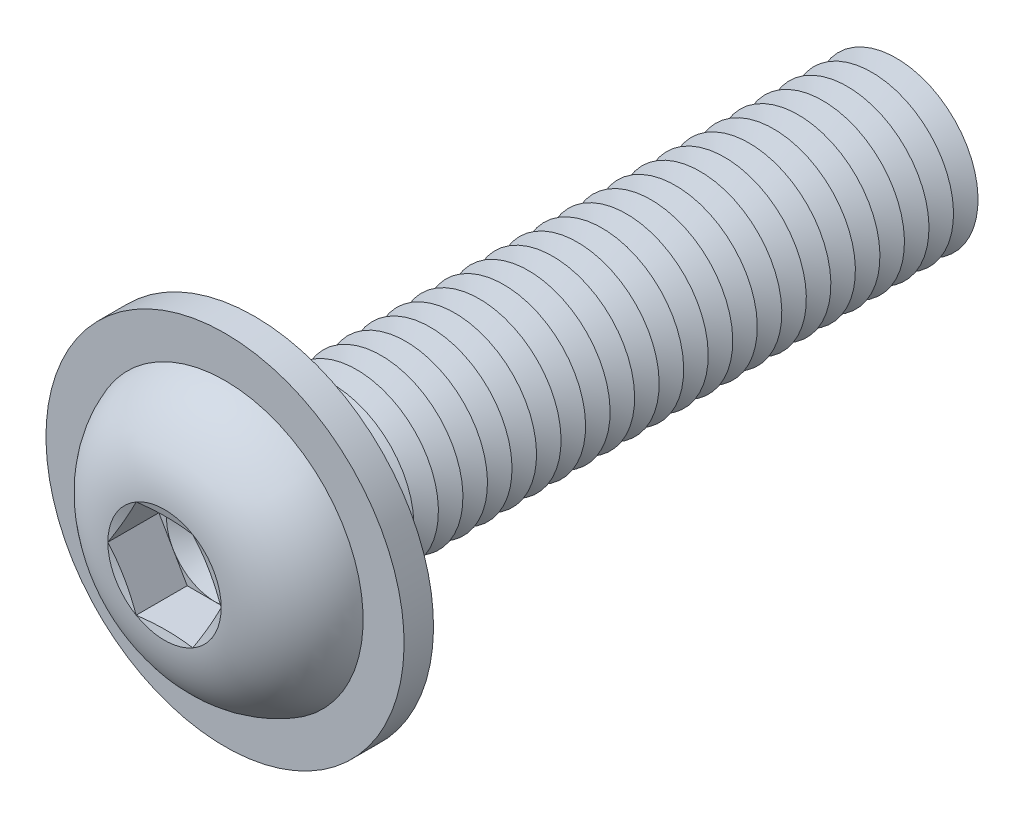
ISO-10303-21;
HEADER;
FILE_DESCRIPTION(('STEP AP214'),'2;1');
FILE_NAME('part.step','',(''),(''),'','','');
FILE_SCHEMA(('AUTOMOTIVE_DESIGN { 1 0 10303 214 1 1 1 1 }'));
ENDSEC;
DATA;
#1=APPLICATION_CONTEXT('core data for automotive mechanical design processes');
#2=APPLICATION_PROTOCOL_DEFINITION('international standard','automotive_design',2000,#1);
#3=PRODUCT_CONTEXT('',#1,'mechanical');
#4=PRODUCT('Part','Part','',(#3));
#5=PRODUCT_RELATED_PRODUCT_CATEGORY('part','',(#4));
#6=PRODUCT_DEFINITION_FORMATION('','',#4);
#7=PRODUCT_DEFINITION_CONTEXT('part definition',#1,'design');
#8=PRODUCT_DEFINITION('design','',#6,#7);
#9=PRODUCT_DEFINITION_SHAPE('','',#8);
#10=(LENGTH_UNIT() NAMED_UNIT(*) SI_UNIT(.MILLI.,.METRE.));
#11=(NAMED_UNIT(*) PLANE_ANGLE_UNIT() SI_UNIT($,.RADIAN.));
#12=(NAMED_UNIT(*) SI_UNIT($,.STERADIAN.) SOLID_ANGLE_UNIT());
#13=UNCERTAINTY_MEASURE_WITH_UNIT(LENGTH_MEASURE(1.E-05),#10,'distance_accuracy_value','');
#14=(GEOMETRIC_REPRESENTATION_CONTEXT(3) GLOBAL_UNCERTAINTY_ASSIGNED_CONTEXT((#13)) GLOBAL_UNIT_ASSIGNED_CONTEXT((#10,
#11,#12)) REPRESENTATION_CONTEXT('',''));
#15=CARTESIAN_POINT('',(0.,0.,0.));
#16=DIRECTION('',(0.,0.,1.));
#17=DIRECTION('',(1.,0.,0.));
#18=AXIS2_PLACEMENT_3D('',#15,#16,#17);
#19=CARTESIAN_POINT('',(0.,0.,-34.75));
#20=DIRECTION('',(0.,0.,1.));
#21=DIRECTION('',(0.,-1.,0.));
#22=AXIS2_PLACEMENT_3D('',#19,#20,#21);
#23=CONICAL_SURFACE('',#22,4.99999999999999,1.0471975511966);
#24=CARTESIAN_POINT('',(0.,0.,-35.5));
#25=DIRECTION('',(0.,0.,1.));
#26=DIRECTION('',(0.,-1.,0.));
#27=AXIS2_PLACEMENT_3D('',#24,#25,#26);
#28=CIRCLE('',#27,3.70096189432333);
#29=CARTESIAN_POINT('',(0.,-3.70096189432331,-35.5));
#30=VERTEX_POINT('',#29);
#31=EDGE_CURVE('E407',#30,#30,#28,.T.);
#32=ORIENTED_EDGE('',*,*,#31,.T.);
#33=EDGE_LOOP('',(#32));
#34=FACE_BOUND('',#33,.T.);
#35=CARTESIAN_POINT('',(0.,0.,-34.75));
#36=DIRECTION('',(0.,0.,1.));
#37=DIRECTION('',(0.,-1.,0.));
#38=AXIS2_PLACEMENT_3D('',#35,#36,#37);
#39=CIRCLE('',#38,4.99999999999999);
#40=CARTESIAN_POINT('',(0.,-4.99999999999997,-34.75));
#41=VERTEX_POINT('',#40);
#42=EDGE_CURVE('E482',#41,#41,#39,.T.);
#43=ORIENTED_EDGE('',*,*,#42,.F.);
#44=EDGE_LOOP('',(#43));
#45=FACE_BOUND('',#44,.T.);
#46=ADVANCED_FACE('F39',(#34,#45),#23,.T.);
#47=CARTESIAN_POINT('',(0.,0.,-35.5));
#48=DIRECTION('',(0.,0.,-1.));
#49=DIRECTION('',(0.,1.,0.));
#50=AXIS2_PLACEMENT_3D('',#47,#48,#49);
#51=CONICAL_SURFACE('',#50,3.70096189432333,1.0471975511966);
#52=CARTESIAN_POINT('',(0.,0.,-36.25));
#53=DIRECTION('',(0.,0.,1.));
#54=DIRECTION('',(0.,-1.,0.));
#55=AXIS2_PLACEMENT_3D('',#52,#53,#54);
#56=CIRCLE('',#55,4.99999999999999);
#57=CARTESIAN_POINT('',(0.,-4.99999999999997,-36.25));
#58=VERTEX_POINT('',#57);
#59=EDGE_CURVE('E404',#58,#58,#56,.T.);
#60=ORIENTED_EDGE('',*,*,#59,.T.);
#61=EDGE_LOOP('',(#60));
#62=FACE_BOUND('',#61,.T.);
#63=ORIENTED_EDGE('',*,*,#31,.F.);
#64=EDGE_LOOP('',(#63));
#65=FACE_BOUND('',#64,.T.);
#66=ADVANCED_FACE('F513',(#62,#65),#51,.T.);
#67=CARTESIAN_POINT('',(0.,5.,-40.));
#68=DIRECTION('',(0.,0.,-1.));
#69=DIRECTION('',(0.,1.,0.));
#70=AXIS2_PLACEMENT_3D('',#67,#68,#69);
#71=PLANE('',#70);
#72=CARTESIAN_POINT('',(0.,0.,-40.));
#73=DIRECTION('',(0.,0.,1.));
#74=DIRECTION('',(0.,-1.,0.));
#75=AXIS2_PLACEMENT_3D('',#72,#73,#74);
#76=CIRCLE('',#75,3.70096189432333);
#77=CARTESIAN_POINT('',(0.,-3.70096189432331,-40.));
#78=VERTEX_POINT('',#77);
#79=EDGE_CURVE('E322',#78,#78,#76,.T.);
#80=ORIENTED_EDGE('',*,*,#79,.F.);
#81=EDGE_LOOP('',(#80));
#82=FACE_BOUND('',#81,.T.);
#83=ADVANCED_FACE('F508',(#82),#71,.T.);
#84=CARTESIAN_POINT('',(0.,0.,-39.25));
#85=DIRECTION('',(0.,0.,1.));
#86=DIRECTION('',(0.,-1.,0.));
#87=AXIS2_PLACEMENT_3D('',#84,#85,#86);
#88=CONICAL_SURFACE('',#87,4.99999999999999,1.0471975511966);
#89=ORIENTED_EDGE('',*,*,#79,.T.);
#90=EDGE_LOOP('',(#89));
#91=FACE_BOUND('',#90,.T.);
#92=CARTESIAN_POINT('',(0.,0.,-39.25));
#93=DIRECTION('',(0.,0.,1.));
#94=DIRECTION('',(0.,-1.,0.));
#95=AXIS2_PLACEMENT_3D('',#92,#93,#94);
#96=CIRCLE('',#95,4.99999999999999);
#97=CARTESIAN_POINT('',(0.,-4.99999999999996,-39.25));
#98=VERTEX_POINT('',#97);
#99=EDGE_CURVE('E377',#98,#98,#96,.T.);
#100=ORIENTED_EDGE('',*,*,#99,.F.);
#101=EDGE_LOOP('',(#100));
#102=FACE_BOUND('',#101,.T.);
#103=ADVANCED_FACE('F499',(#91,#102),#88,.T.);
#104=CARTESIAN_POINT('',(0.,0.,-38.5));
#105=DIRECTION('',(0.,0.,-1.));
#106=DIRECTION('',(0.,1.,0.));
#107=AXIS2_PLACEMENT_3D('',#104,#105,#106);
#108=CONICAL_SURFACE('',#107,3.70096189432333,1.0471975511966);
#109=ORIENTED_EDGE('',*,*,#99,.T.);
#110=EDGE_LOOP('',(#109));
#111=FACE_BOUND('',#110,.T.);
#112=CARTESIAN_POINT('',(0.,0.,-38.5));
#113=DIRECTION('',(0.,0.,1.));
#114=DIRECTION('',(0.,-1.,0.));
#115=AXIS2_PLACEMENT_3D('',#112,#113,#114);
#116=CIRCLE('',#115,3.70096189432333);
#117=CARTESIAN_POINT('',(0.,-3.70096189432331,-38.5));
#118=VERTEX_POINT('',#117);
#119=EDGE_CURVE('E396',#118,#118,#116,.T.);
#120=ORIENTED_EDGE('',*,*,#119,.F.);
#121=EDGE_LOOP('',(#120));
#122=FACE_BOUND('',#121,.T.);
#123=ADVANCED_FACE('F497',(#111,#122),#108,.T.);
#124=CARTESIAN_POINT('',(0.,0.,-37.75));
#125=DIRECTION('',(0.,0.,1.));
#126=DIRECTION('',(0.,-1.,0.));
#127=AXIS2_PLACEMENT_3D('',#124,#125,#126);
#128=CONICAL_SURFACE('',#127,4.99999999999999,1.0471975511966);
#129=ORIENTED_EDGE('',*,*,#119,.T.);
#130=EDGE_LOOP('',(#129));
#131=FACE_BOUND('',#130,.T.);
#132=CARTESIAN_POINT('',(0.,0.,-37.75));
#133=DIRECTION('',(0.,0.,1.));
#134=DIRECTION('',(0.,-1.,0.));
#135=AXIS2_PLACEMENT_3D('',#132,#133,#134);
#136=CIRCLE('',#135,4.99999999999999);
#137=CARTESIAN_POINT('',(0.,-4.99999999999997,-37.75));
#138=VERTEX_POINT('',#137);
#139=EDGE_CURVE('E393',#138,#138,#136,.T.);
#140=ORIENTED_EDGE('',*,*,#139,.F.);
#141=EDGE_LOOP('',(#140));
#142=FACE_BOUND('',#141,.T.);
#143=ADVANCED_FACE('F494',(#131,#142),#128,.T.);
#144=CARTESIAN_POINT('',(0.,0.,-37.));
#145=DIRECTION('',(0.,0.,-1.));
#146=DIRECTION('',(0.,1.,0.));
#147=AXIS2_PLACEMENT_3D('',#144,#145,#146);
#148=CONICAL_SURFACE('',#147,3.70096189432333,1.0471975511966);
#149=ORIENTED_EDGE('',*,*,#139,.T.);
#150=EDGE_LOOP('',(#149));
#151=FACE_BOUND('',#150,.T.);
#152=CARTESIAN_POINT('',(0.,0.,-37.));
#153=DIRECTION('',(0.,0.,1.));
#154=DIRECTION('',(0.,-1.,0.));
#155=AXIS2_PLACEMENT_3D('',#152,#153,#154);
#156=CIRCLE('',#155,3.70096189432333);
#157=CARTESIAN_POINT('',(0.,-3.70096189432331,-37.));
#158=VERTEX_POINT('',#157);
#159=EDGE_CURVE('E397',#158,#158,#156,.T.);
#160=ORIENTED_EDGE('',*,*,#159,.F.);
#161=EDGE_LOOP('',(#160));
#162=FACE_BOUND('',#161,.T.);
#163=ADVANCED_FACE('F506',(#151,#162),#148,.T.);
#164=CARTESIAN_POINT('',(0.,0.,-36.25));
#165=DIRECTION('',(0.,0.,1.));
#166=DIRECTION('',(0.,-1.,0.));
#167=AXIS2_PLACEMENT_3D('',#164,#165,#166);
#168=CONICAL_SURFACE('',#167,4.99999999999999,1.0471975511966);
#169=ORIENTED_EDGE('',*,*,#159,.T.);
#170=EDGE_LOOP('',(#169));
#171=FACE_BOUND('',#170,.T.);
#172=ORIENTED_EDGE('',*,*,#59,.F.);
#173=EDGE_LOOP('',(#172));
#174=FACE_BOUND('',#173,.T.);
#175=ADVANCED_FACE('F525',(#171,#174),#168,.T.);
#176=CARTESIAN_POINT('',(0.,0.,-33.25));
#177=DIRECTION('',(0.,0.,1.));
#178=DIRECTION('',(0.,-1.,0.));
#179=AXIS2_PLACEMENT_3D('',#176,#177,#178);
#180=CONICAL_SURFACE('',#179,4.99999999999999,1.0471975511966);
#181=CARTESIAN_POINT('',(0.,0.,-34.));
#182=DIRECTION('',(0.,0.,1.));
#183=DIRECTION('',(0.,-1.,0.));
#184=AXIS2_PLACEMENT_3D('',#181,#182,#183);
#185=CIRCLE('',#184,3.70096189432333);
#186=CARTESIAN_POINT('',(0.,-3.70096189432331,-34.));
#187=VERTEX_POINT('',#186);
#188=EDGE_CURVE('E350',#187,#187,#185,.T.);
#189=ORIENTED_EDGE('',*,*,#188,.T.);
#190=EDGE_LOOP('',(#189));
#191=FACE_BOUND('',#190,.T.);
#192=CARTESIAN_POINT('',(0.,0.,-33.25));
#193=DIRECTION('',(0.,0.,1.));
#194=DIRECTION('',(0.,-1.,0.));
#195=AXIS2_PLACEMENT_3D('',#192,#193,#194);
#196=CIRCLE('',#195,4.99999999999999);
#197=CARTESIAN_POINT('',(0.,-4.99999999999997,-33.25));
#198=VERTEX_POINT('',#197);
#199=EDGE_CURVE('E348',#198,#198,#196,.T.);
#200=ORIENTED_EDGE('',*,*,#199,.F.);
#201=EDGE_LOOP('',(#200));
#202=FACE_BOUND('',#201,.T.);
#203=ADVANCED_FACE('F528',(#191,#202),#180,.T.);
#204=CARTESIAN_POINT('',(0.,0.,-34.));
#205=DIRECTION('',(0.,0.,-1.));
#206=DIRECTION('',(0.,1.,0.));
#207=AXIS2_PLACEMENT_3D('',#204,#205,#206);
#208=CONICAL_SURFACE('',#207,3.70096189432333,1.0471975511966);
#209=ORIENTED_EDGE('',*,*,#42,.T.);
#210=EDGE_LOOP('',(#209));
#211=FACE_BOUND('',#210,.T.);
#212=ORIENTED_EDGE('',*,*,#188,.F.);
#213=EDGE_LOOP('',(#212));
#214=FACE_BOUND('',#213,.T.);
#215=ADVANCED_FACE('F533',(#211,#214),#208,.T.);
#216=CARTESIAN_POINT('',(0.,0.,-31.75));
#217=DIRECTION('',(0.,0.,1.));
#218=DIRECTION('',(0.,-1.,0.));
#219=AXIS2_PLACEMENT_3D('',#216,#217,#218);
#220=CONICAL_SURFACE('',#219,4.99999999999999,1.0471975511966);
#221=CARTESIAN_POINT('',(0.,0.,-32.5));
#222=DIRECTION('',(0.,0.,1.));
#223=DIRECTION('',(0.,-1.,0.));
#224=AXIS2_PLACEMENT_3D('',#221,#222,#223);
#225=CIRCLE('',#224,3.70096189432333);
#226=CARTESIAN_POINT('',(0.,-3.70096189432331,-32.5));
#227=VERTEX_POINT('',#226);
#228=EDGE_CURVE('E351',#227,#227,#225,.T.);
#229=ORIENTED_EDGE('',*,*,#228,.T.);
#230=EDGE_LOOP('',(#229));
#231=FACE_BOUND('',#230,.T.);
#232=CARTESIAN_POINT('',(0.,0.,-31.75));
#233=DIRECTION('',(0.,0.,1.));
#234=DIRECTION('',(0.,-1.,0.));
#235=AXIS2_PLACEMENT_3D('',#232,#233,#234);
#236=CIRCLE('',#235,4.99999999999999);
#237=CARTESIAN_POINT('',(0.,-4.99999999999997,-31.75));
#238=VERTEX_POINT('',#237);
#239=EDGE_CURVE('E472',#238,#238,#236,.T.);
#240=ORIENTED_EDGE('',*,*,#239,.F.);
#241=EDGE_LOOP('',(#240));
#242=FACE_BOUND('',#241,.T.);
#243=ADVANCED_FACE('F544',(#231,#242),#220,.T.);
#244=CARTESIAN_POINT('',(0.,0.,-32.5));
#245=DIRECTION('',(0.,0.,-1.));
#246=DIRECTION('',(0.,1.,0.));
#247=AXIS2_PLACEMENT_3D('',#244,#245,#246);
#248=CONICAL_SURFACE('',#247,3.70096189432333,1.0471975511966);
#249=ORIENTED_EDGE('',*,*,#199,.T.);
#250=EDGE_LOOP('',(#249));
#251=FACE_BOUND('',#250,.T.);
#252=ORIENTED_EDGE('',*,*,#228,.F.);
#253=EDGE_LOOP('',(#252));
#254=FACE_BOUND('',#253,.T.);
#255=ADVANCED_FACE('F551',(#251,#254),#248,.T.);
#256=CARTESIAN_POINT('',(0.,0.,-30.25));
#257=DIRECTION('',(0.,0.,1.));
#258=DIRECTION('',(0.,-1.,0.));
#259=AXIS2_PLACEMENT_3D('',#256,#257,#258);
#260=CONICAL_SURFACE('',#259,4.99999999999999,1.0471975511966);
#261=CARTESIAN_POINT('',(0.,0.,-31.));
#262=DIRECTION('',(0.,0.,1.));
#263=DIRECTION('',(0.,-1.,0.));
#264=AXIS2_PLACEMENT_3D('',#261,#262,#263);
#265=CIRCLE('',#264,3.70096189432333);
#266=CARTESIAN_POINT('',(0.,-3.70096189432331,-31.));
#267=VERTEX_POINT('',#266);
#268=EDGE_CURVE('E345',#267,#267,#265,.T.);
#269=ORIENTED_EDGE('',*,*,#268,.T.);
#270=EDGE_LOOP('',(#269));
#271=FACE_BOUND('',#270,.T.);
#272=CARTESIAN_POINT('',(0.,0.,-30.25));
#273=DIRECTION('',(0.,0.,1.));
#274=DIRECTION('',(0.,-1.,0.));
#275=AXIS2_PLACEMENT_3D('',#272,#273,#274);
#276=CIRCLE('',#275,4.99999999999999);
#277=CARTESIAN_POINT('',(0.,-4.99999999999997,-30.25));
#278=VERTEX_POINT('',#277);
#279=EDGE_CURVE('E342',#278,#278,#276,.T.);
#280=ORIENTED_EDGE('',*,*,#279,.F.);
#281=EDGE_LOOP('',(#280));
#282=FACE_BOUND('',#281,.T.);
#283=ADVANCED_FACE('F555',(#271,#282),#260,.T.);
#284=CARTESIAN_POINT('',(0.,0.,-31.));
#285=DIRECTION('',(0.,0.,-1.));
#286=DIRECTION('',(0.,1.,0.));
#287=AXIS2_PLACEMENT_3D('',#284,#285,#286);
#288=CONICAL_SURFACE('',#287,3.70096189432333,1.0471975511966);
#289=ORIENTED_EDGE('',*,*,#239,.T.);
#290=EDGE_LOOP('',(#289));
#291=FACE_BOUND('',#290,.T.);
#292=ORIENTED_EDGE('',*,*,#268,.F.);
#293=EDGE_LOOP('',(#292));
#294=FACE_BOUND('',#293,.T.);
#295=ADVANCED_FACE('F559',(#291,#294),#288,.T.);
#296=CARTESIAN_POINT('',(0.,0.,-28.75));
#297=DIRECTION('',(0.,0.,1.));
#298=DIRECTION('',(0.,-1.,0.));
#299=AXIS2_PLACEMENT_3D('',#296,#297,#298);
#300=CONICAL_SURFACE('',#299,4.99999999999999,1.0471975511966);
#301=CARTESIAN_POINT('',(0.,0.,-29.5));
#302=DIRECTION('',(0.,0.,1.));
#303=DIRECTION('',(0.,-1.,0.));
#304=AXIS2_PLACEMENT_3D('',#301,#302,#303);
#305=CIRCLE('',#304,3.70096189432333);
#306=CARTESIAN_POINT('',(0.,-3.70096189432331,-29.5));
#307=VERTEX_POINT('',#306);
#308=EDGE_CURVE('E346',#307,#307,#305,.T.);
#309=ORIENTED_EDGE('',*,*,#308,.T.);
#310=EDGE_LOOP('',(#309));
#311=FACE_BOUND('',#310,.T.);
#312=CARTESIAN_POINT('',(0.,0.,-28.75));
#313=DIRECTION('',(0.,0.,1.));
#314=DIRECTION('',(0.,-1.,0.));
#315=AXIS2_PLACEMENT_3D('',#312,#313,#314);
#316=CIRCLE('',#315,4.99999999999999);
#317=CARTESIAN_POINT('',(0.,-4.99999999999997,-28.75));
#318=VERTEX_POINT('',#317);
#319=EDGE_CURVE('E327',#318,#318,#316,.T.);
#320=ORIENTED_EDGE('',*,*,#319,.F.);
#321=EDGE_LOOP('',(#320));
#322=FACE_BOUND('',#321,.T.);
#323=ADVANCED_FACE('F563',(#311,#322),#300,.T.);
#324=CARTESIAN_POINT('',(0.,0.,-29.5));
#325=DIRECTION('',(0.,0.,-1.));
#326=DIRECTION('',(0.,1.,0.));
#327=AXIS2_PLACEMENT_3D('',#324,#325,#326);
#328=CONICAL_SURFACE('',#327,3.70096189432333,1.0471975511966);
#329=ORIENTED_EDGE('',*,*,#279,.T.);
#330=EDGE_LOOP('',(#329));
#331=FACE_BOUND('',#330,.T.);
#332=ORIENTED_EDGE('',*,*,#308,.F.);
#333=EDGE_LOOP('',(#332));
#334=FACE_BOUND('',#333,.T.);
#335=ADVANCED_FACE('F567',(#331,#334),#328,.T.);
#336=CARTESIAN_POINT('',(0.,0.,-27.25));
#337=DIRECTION('',(0.,0.,1.));
#338=DIRECTION('',(0.,-1.,0.));
#339=AXIS2_PLACEMENT_3D('',#336,#337,#338);
#340=CONICAL_SURFACE('',#339,4.99999999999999,1.0471975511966);
#341=CARTESIAN_POINT('',(0.,0.,-28.));
#342=DIRECTION('',(0.,0.,1.));
#343=DIRECTION('',(0.,-1.,0.));
#344=AXIS2_PLACEMENT_3D('',#341,#342,#343);
#345=CIRCLE('',#344,3.70096189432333);
#346=CARTESIAN_POINT('',(0.,-3.70096189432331,-28.));
#347=VERTEX_POINT('',#346);
#348=EDGE_CURVE('E460',#347,#347,#345,.T.);
#349=ORIENTED_EDGE('',*,*,#348,.T.);
#350=EDGE_LOOP('',(#349));
#351=FACE_BOUND('',#350,.T.);
#352=CARTESIAN_POINT('',(0.,0.,-27.25));
#353=DIRECTION('',(0.,0.,1.));
#354=DIRECTION('',(0.,-1.,0.));
#355=AXIS2_PLACEMENT_3D('',#352,#353,#354);
#356=CIRCLE('',#355,4.99999999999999);
#357=CARTESIAN_POINT('',(0.,-4.99999999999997,-27.25));
#358=VERTEX_POINT('',#357);
#359=EDGE_CURVE('E456',#358,#358,#356,.T.);
#360=ORIENTED_EDGE('',*,*,#359,.F.);
#361=EDGE_LOOP('',(#360));
#362=FACE_BOUND('',#361,.T.);
#363=ADVANCED_FACE('F571',(#351,#362),#340,.T.);
#364=CARTESIAN_POINT('',(0.,0.,-28.));
#365=DIRECTION('',(0.,0.,-1.));
#366=DIRECTION('',(0.,1.,0.));
#367=AXIS2_PLACEMENT_3D('',#364,#365,#366);
#368=CONICAL_SURFACE('',#367,3.70096189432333,1.0471975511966);
#369=ORIENTED_EDGE('',*,*,#319,.T.);
#370=EDGE_LOOP('',(#369));
#371=FACE_BOUND('',#370,.T.);
#372=ORIENTED_EDGE('',*,*,#348,.F.);
#373=EDGE_LOOP('',(#372));
#374=FACE_BOUND('',#373,.T.);
#375=ADVANCED_FACE('F575',(#371,#374),#368,.T.);
#376=CARTESIAN_POINT('',(0.,0.,-25.75));
#377=DIRECTION('',(0.,0.,1.));
#378=DIRECTION('',(0.,-1.,0.));
#379=AXIS2_PLACEMENT_3D('',#376,#377,#378);
#380=CONICAL_SURFACE('',#379,4.99999999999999,1.0471975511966);
#381=CARTESIAN_POINT('',(0.,0.,-26.5));
#382=DIRECTION('',(0.,0.,1.));
#383=DIRECTION('',(0.,-1.,0.));
#384=AXIS2_PLACEMENT_3D('',#381,#382,#383);
#385=CIRCLE('',#384,3.70096189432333);
#386=CARTESIAN_POINT('',(0.,-3.70096189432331,-26.5));
#387=VERTEX_POINT('',#386);
#388=EDGE_CURVE('E452',#387,#387,#385,.T.);
#389=ORIENTED_EDGE('',*,*,#388,.T.);
#390=EDGE_LOOP('',(#389));
#391=FACE_BOUND('',#390,.T.);
#392=CARTESIAN_POINT('',(0.,0.,-25.75));
#393=DIRECTION('',(0.,0.,1.));
#394=DIRECTION('',(0.,-1.,0.));
#395=AXIS2_PLACEMENT_3D('',#392,#393,#394);
#396=CIRCLE('',#395,4.99999999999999);
#397=CARTESIAN_POINT('',(0.,-4.99999999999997,-25.75));
#398=VERTEX_POINT('',#397);
#399=EDGE_CURVE('E448',#398,#398,#396,.T.);
#400=ORIENTED_EDGE('',*,*,#399,.F.);
#401=EDGE_LOOP('',(#400));
#402=FACE_BOUND('',#401,.T.);
#403=ADVANCED_FACE('F579',(#391,#402),#380,.T.);
#404=CARTESIAN_POINT('',(0.,0.,-26.5));
#405=DIRECTION('',(0.,0.,-1.));
#406=DIRECTION('',(0.,1.,0.));
#407=AXIS2_PLACEMENT_3D('',#404,#405,#406);
#408=CONICAL_SURFACE('',#407,3.70096189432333,1.0471975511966);
#409=ORIENTED_EDGE('',*,*,#359,.T.);
#410=EDGE_LOOP('',(#409));
#411=FACE_BOUND('',#410,.T.);
#412=ORIENTED_EDGE('',*,*,#388,.F.);
#413=EDGE_LOOP('',(#412));
#414=FACE_BOUND('',#413,.T.);
#415=ADVANCED_FACE('F583',(#411,#414),#408,.T.);
#416=CARTESIAN_POINT('',(0.,0.,-24.25));
#417=DIRECTION('',(0.,0.,1.));
#418=DIRECTION('',(0.,-1.,0.));
#419=AXIS2_PLACEMENT_3D('',#416,#417,#418);
#420=CONICAL_SURFACE('',#419,4.99999999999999,1.0471975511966);
#421=CARTESIAN_POINT('',(0.,0.,-25.));
#422=DIRECTION('',(0.,0.,1.));
#423=DIRECTION('',(0.,-1.,0.));
#424=AXIS2_PLACEMENT_3D('',#421,#422,#423);
#425=CIRCLE('',#424,3.70096189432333);
#426=CARTESIAN_POINT('',(0.,-3.70096189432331,-25.));
#427=VERTEX_POINT('',#426);
#428=EDGE_CURVE('E445',#427,#427,#425,.T.);
#429=ORIENTED_EDGE('',*,*,#428,.T.);
#430=EDGE_LOOP('',(#429));
#431=FACE_BOUND('',#430,.T.);
#432=CARTESIAN_POINT('',(0.,0.,-24.25));
#433=DIRECTION('',(0.,0.,1.));
#434=DIRECTION('',(0.,-1.,0.));
#435=AXIS2_PLACEMENT_3D('',#432,#433,#434);
#436=CIRCLE('',#435,4.99999999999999);
#437=CARTESIAN_POINT('',(0.,-4.99999999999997,-24.25));
#438=VERTEX_POINT('',#437);
#439=EDGE_CURVE('E373',#438,#438,#436,.T.);
#440=ORIENTED_EDGE('',*,*,#439,.F.);
#441=EDGE_LOOP('',(#440));
#442=FACE_BOUND('',#441,.T.);
#443=ADVANCED_FACE('F587',(#431,#442),#420,.T.);
#444=CARTESIAN_POINT('',(0.,0.,-25.));
#445=DIRECTION('',(0.,0.,-1.));
#446=DIRECTION('',(0.,1.,0.));
#447=AXIS2_PLACEMENT_3D('',#444,#445,#446);
#448=CONICAL_SURFACE('',#447,3.70096189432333,1.0471975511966);
#449=ORIENTED_EDGE('',*,*,#399,.T.);
#450=EDGE_LOOP('',(#449));
#451=FACE_BOUND('',#450,.T.);
#452=ORIENTED_EDGE('',*,*,#428,.F.);
#453=EDGE_LOOP('',(#452));
#454=FACE_BOUND('',#453,.T.);
#455=ADVANCED_FACE('F591',(#451,#454),#448,.T.);
#456=CARTESIAN_POINT('',(0.,0.,-22.75));
#457=DIRECTION('',(0.,0.,1.));
#458=DIRECTION('',(0.,-1.,0.));
#459=AXIS2_PLACEMENT_3D('',#456,#457,#458);
#460=CONICAL_SURFACE('',#459,4.99999999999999,1.0471975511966);
#461=CARTESIAN_POINT('',(0.,0.,-23.5));
#462=DIRECTION('',(0.,0.,1.));
#463=DIRECTION('',(0.,-1.,0.));
#464=AXIS2_PLACEMENT_3D('',#461,#462,#463);
#465=CIRCLE('',#464,3.70096189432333);
#466=CARTESIAN_POINT('',(0.,-3.70096189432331,-23.5));
#467=VERTEX_POINT('',#466);
#468=EDGE_CURVE('E370',#467,#467,#465,.T.);
#469=ORIENTED_EDGE('',*,*,#468,.T.);
#470=EDGE_LOOP('',(#469));
#471=FACE_BOUND('',#470,.T.);
#472=CARTESIAN_POINT('',(0.,0.,-22.75));
#473=DIRECTION('',(0.,0.,1.));
#474=DIRECTION('',(0.,-1.,0.));
#475=AXIS2_PLACEMENT_3D('',#472,#473,#474);
#476=CIRCLE('',#475,4.99999999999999);
#477=CARTESIAN_POINT('',(0.,-4.99999999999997,-22.75));
#478=VERTEX_POINT('',#477);
#479=EDGE_CURVE('E374',#478,#478,#476,.T.);
#480=ORIENTED_EDGE('',*,*,#479,.F.);
#481=EDGE_LOOP('',(#480));
#482=FACE_BOUND('',#481,.T.);
#483=ADVANCED_FACE('F595',(#471,#482),#460,.T.);
#484=CARTESIAN_POINT('',(0.,0.,-23.5));
#485=DIRECTION('',(0.,0.,-1.));
#486=DIRECTION('',(0.,1.,0.));
#487=AXIS2_PLACEMENT_3D('',#484,#485,#486);
#488=CONICAL_SURFACE('',#487,3.70096189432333,1.0471975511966);
#489=ORIENTED_EDGE('',*,*,#439,.T.);
#490=EDGE_LOOP('',(#489));
#491=FACE_BOUND('',#490,.T.);
#492=ORIENTED_EDGE('',*,*,#468,.F.);
#493=EDGE_LOOP('',(#492));
#494=FACE_BOUND('',#493,.T.);
#495=ADVANCED_FACE('F599',(#491,#494),#488,.T.);
#496=CARTESIAN_POINT('',(0.,0.,-21.25));
#497=DIRECTION('',(0.,0.,1.));
#498=DIRECTION('',(0.,-1.,0.));
#499=AXIS2_PLACEMENT_3D('',#496,#497,#498);
#500=CONICAL_SURFACE('',#499,4.99999999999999,1.0471975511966);
#501=CARTESIAN_POINT('',(0.,0.,-22.));
#502=DIRECTION('',(0.,0.,1.));
#503=DIRECTION('',(0.,-1.,0.));
#504=AXIS2_PLACEMENT_3D('',#501,#502,#503);
#505=CIRCLE('',#504,3.70096189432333);
#506=CARTESIAN_POINT('',(0.,-3.70096189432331,-22.));
#507=VERTEX_POINT('',#506);
#508=EDGE_CURVE('E431',#507,#507,#505,.T.);
#509=ORIENTED_EDGE('',*,*,#508,.T.);
#510=EDGE_LOOP('',(#509));
#511=FACE_BOUND('',#510,.T.);
#512=CARTESIAN_POINT('',(0.,0.,-21.25));
#513=DIRECTION('',(0.,0.,1.));
#514=DIRECTION('',(0.,-1.,0.));
#515=AXIS2_PLACEMENT_3D('',#512,#513,#514);
#516=CIRCLE('',#515,4.99999999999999);
#517=CARTESIAN_POINT('',(0.,-4.99999999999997,-21.25));
#518=VERTEX_POINT('',#517);
#519=EDGE_CURVE('E415',#518,#518,#516,.T.);
#520=ORIENTED_EDGE('',*,*,#519,.F.);
#521=EDGE_LOOP('',(#520));
#522=FACE_BOUND('',#521,.T.);
#523=ADVANCED_FACE('F603',(#511,#522),#500,.T.);
#524=CARTESIAN_POINT('',(0.,0.,-22.));
#525=DIRECTION('',(0.,0.,-1.));
#526=DIRECTION('',(0.,1.,0.));
#527=AXIS2_PLACEMENT_3D('',#524,#525,#526);
#528=CONICAL_SURFACE('',#527,3.70096189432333,1.0471975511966);
#529=ORIENTED_EDGE('',*,*,#479,.T.);
#530=EDGE_LOOP('',(#529));
#531=FACE_BOUND('',#530,.T.);
#532=ORIENTED_EDGE('',*,*,#508,.F.);
#533=EDGE_LOOP('',(#532));
#534=FACE_BOUND('',#533,.T.);
#535=ADVANCED_FACE('F607',(#531,#534),#528,.T.);
#536=CARTESIAN_POINT('',(0.,0.,-19.75));
#537=DIRECTION('',(0.,0.,1.));
#538=DIRECTION('',(0.,-1.,0.));
#539=AXIS2_PLACEMENT_3D('',#536,#537,#538);
#540=CONICAL_SURFACE('',#539,4.99999999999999,1.0471975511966);
#541=CARTESIAN_POINT('',(0.,0.,-20.5));
#542=DIRECTION('',(0.,0.,1.));
#543=DIRECTION('',(0.,-1.,0.));
#544=AXIS2_PLACEMENT_3D('',#541,#542,#543);
#545=CIRCLE('',#544,3.70096189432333);
#546=CARTESIAN_POINT('',(0.,-3.70096189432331,-20.5));
#547=VERTEX_POINT('',#546);
#548=EDGE_CURVE('E425',#547,#547,#545,.T.);
#549=ORIENTED_EDGE('',*,*,#548,.T.);
#550=EDGE_LOOP('',(#549));
#551=FACE_BOUND('',#550,.T.);
#552=CARTESIAN_POINT('',(0.,0.,-19.75));
#553=DIRECTION('',(0.,0.,1.));
#554=DIRECTION('',(0.,-1.,0.));
#555=AXIS2_PLACEMENT_3D('',#552,#553,#554);
#556=CIRCLE('',#555,4.99999999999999);
#557=CARTESIAN_POINT('',(0.,-4.99999999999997,-19.75));
#558=VERTEX_POINT('',#557);
#559=EDGE_CURVE('E339',#558,#558,#556,.T.);
#560=ORIENTED_EDGE('',*,*,#559,.F.);
#561=EDGE_LOOP('',(#560));
#562=FACE_BOUND('',#561,.T.);
#563=ADVANCED_FACE('F611',(#551,#562),#540,.T.);
#564=CARTESIAN_POINT('',(0.,0.,-20.5));
#565=DIRECTION('',(0.,0.,-1.));
#566=DIRECTION('',(0.,1.,0.));
#567=AXIS2_PLACEMENT_3D('',#564,#565,#566);
#568=CONICAL_SURFACE('',#567,3.70096189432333,1.0471975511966);
#569=ORIENTED_EDGE('',*,*,#519,.T.);
#570=EDGE_LOOP('',(#569));
#571=FACE_BOUND('',#570,.T.);
#572=ORIENTED_EDGE('',*,*,#548,.F.);
#573=EDGE_LOOP('',(#572));
#574=FACE_BOUND('',#573,.T.);
#575=ADVANCED_FACE('F615',(#571,#574),#568,.T.);
#576=CARTESIAN_POINT('',(0.,0.,-18.25));
#577=DIRECTION('',(0.,0.,1.));
#578=DIRECTION('',(0.,-1.,0.));
#579=AXIS2_PLACEMENT_3D('',#576,#577,#578);
#580=CONICAL_SURFACE('',#579,4.99999999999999,1.0471975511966);
#581=CARTESIAN_POINT('',(0.,0.,-19.));
#582=DIRECTION('',(0.,0.,1.));
#583=DIRECTION('',(0.,-1.,0.));
#584=AXIS2_PLACEMENT_3D('',#581,#582,#583);
#585=CIRCLE('',#584,3.70096189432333);
#586=CARTESIAN_POINT('',(0.,-3.70096189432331,-19.));
#587=VERTEX_POINT('',#586);
#588=EDGE_CURVE('E336',#587,#587,#585,.T.);
#589=ORIENTED_EDGE('',*,*,#588,.T.);
#590=EDGE_LOOP('',(#589));
#591=FACE_BOUND('',#590,.T.);
#592=CARTESIAN_POINT('',(0.,0.,-18.25));
#593=DIRECTION('',(0.,0.,1.));
#594=DIRECTION('',(0.,-1.,0.));
#595=AXIS2_PLACEMENT_3D('',#592,#593,#594);
#596=CIRCLE('',#595,4.99999999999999);
#597=CARTESIAN_POINT('',(0.,-4.99999999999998,-18.25));
#598=VERTEX_POINT('',#597);
#599=EDGE_CURVE('E340',#598,#598,#596,.T.);
#600=ORIENTED_EDGE('',*,*,#599,.F.);
#601=EDGE_LOOP('',(#600));
#602=FACE_BOUND('',#601,.T.);
#603=ADVANCED_FACE('F618',(#591,#602),#580,.T.);
#604=CARTESIAN_POINT('',(0.,0.,-19.));
#605=DIRECTION('',(0.,0.,-1.));
#606=DIRECTION('',(0.,1.,0.));
#607=AXIS2_PLACEMENT_3D('',#604,#605,#606);
#608=CONICAL_SURFACE('',#607,3.70096189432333,1.0471975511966);
#609=ORIENTED_EDGE('',*,*,#559,.T.);
#610=EDGE_LOOP('',(#609));
#611=FACE_BOUND('',#610,.T.);
#612=ORIENTED_EDGE('',*,*,#588,.F.);
#613=EDGE_LOOP('',(#612));
#614=FACE_BOUND('',#613,.T.);
#615=ADVANCED_FACE('F622',(#611,#614),#608,.T.);
#616=CARTESIAN_POINT('',(0.,0.,-16.75));
#617=DIRECTION('',(0.,0.,1.));
#618=DIRECTION('',(0.,-1.,0.));
#619=AXIS2_PLACEMENT_3D('',#616,#617,#618);
#620=CONICAL_SURFACE('',#619,4.99999999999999,1.0471975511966);
#621=CARTESIAN_POINT('',(0.,0.,-17.5));
#622=DIRECTION('',(0.,0.,1.));
#623=DIRECTION('',(0.,-1.,0.));
#624=AXIS2_PLACEMENT_3D('',#621,#622,#623);
#625=CIRCLE('',#624,3.70096189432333);
#626=CARTESIAN_POINT('',(0.,-3.70096189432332,-17.5));
#627=VERTEX_POINT('',#626);
#628=EDGE_CURVE('E365',#627,#627,#625,.T.);
#629=ORIENTED_EDGE('',*,*,#628,.T.);
#630=EDGE_LOOP('',(#629));
#631=FACE_BOUND('',#630,.T.);
#632=CARTESIAN_POINT('',(0.,0.,-16.75));
#633=DIRECTION('',(0.,0.,1.));
#634=DIRECTION('',(0.,-1.,0.));
#635=AXIS2_PLACEMENT_3D('',#632,#633,#634);
#636=CIRCLE('',#635,4.99999999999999);
#637=CARTESIAN_POINT('',(0.,-4.99999999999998,-16.75));
#638=VERTEX_POINT('',#637);
#639=EDGE_CURVE('E368',#638,#638,#636,.T.);
#640=ORIENTED_EDGE('',*,*,#639,.F.);
#641=EDGE_LOOP('',(#640));
#642=FACE_BOUND('',#641,.T.);
#643=ADVANCED_FACE('F626',(#631,#642),#620,.T.);
#644=CARTESIAN_POINT('',(0.,0.,-17.5));
#645=DIRECTION('',(0.,0.,-1.));
#646=DIRECTION('',(0.,1.,0.));
#647=AXIS2_PLACEMENT_3D('',#644,#645,#646);
#648=CONICAL_SURFACE('',#647,3.70096189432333,1.0471975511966);
#649=ORIENTED_EDGE('',*,*,#599,.T.);
#650=EDGE_LOOP('',(#649));
#651=FACE_BOUND('',#650,.T.);
#652=ORIENTED_EDGE('',*,*,#628,.F.);
#653=EDGE_LOOP('',(#652));
#654=FACE_BOUND('',#653,.T.);
#655=ADVANCED_FACE('F630',(#651,#654),#648,.T.);
#656=CARTESIAN_POINT('',(0.,0.,-15.25));
#657=DIRECTION('',(0.,0.,1.));
#658=DIRECTION('',(0.,-1.,0.));
#659=AXIS2_PLACEMENT_3D('',#656,#657,#658);
#660=CONICAL_SURFACE('',#659,4.99999999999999,1.0471975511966);
#661=CARTESIAN_POINT('',(0.,0.,-16.));
#662=DIRECTION('',(0.,0.,1.));
#663=DIRECTION('',(0.,-1.,0.));
#664=AXIS2_PLACEMENT_3D('',#661,#662,#663);
#665=CIRCLE('',#664,3.70096189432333);
#666=CARTESIAN_POINT('',(0.,-3.70096189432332,-16.));
#667=VERTEX_POINT('',#666);
#668=EDGE_CURVE('E390',#667,#667,#665,.T.);
#669=ORIENTED_EDGE('',*,*,#668,.T.);
#670=EDGE_LOOP('',(#669));
#671=FACE_BOUND('',#670,.T.);
#672=CARTESIAN_POINT('',(0.,0.,-15.25));
#673=DIRECTION('',(0.,0.,1.));
#674=DIRECTION('',(0.,-1.,0.));
#675=AXIS2_PLACEMENT_3D('',#672,#673,#674);
#676=CIRCLE('',#675,4.99999999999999);
#677=CARTESIAN_POINT('',(0.,-4.99999999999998,-15.25));
#678=VERTEX_POINT('',#677);
#679=EDGE_CURVE('E387',#678,#678,#676,.T.);
#680=ORIENTED_EDGE('',*,*,#679,.F.);
#681=EDGE_LOOP('',(#680));
#682=FACE_BOUND('',#681,.T.);
#683=ADVANCED_FACE('F634',(#671,#682),#660,.T.);
#684=CARTESIAN_POINT('',(0.,0.,-16.));
#685=DIRECTION('',(0.,0.,-1.));
#686=DIRECTION('',(0.,1.,0.));
#687=AXIS2_PLACEMENT_3D('',#684,#685,#686);
#688=CONICAL_SURFACE('',#687,3.70096189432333,1.0471975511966);
#689=ORIENTED_EDGE('',*,*,#639,.T.);
#690=EDGE_LOOP('',(#689));
#691=FACE_BOUND('',#690,.T.);
#692=ORIENTED_EDGE('',*,*,#668,.F.);
#693=EDGE_LOOP('',(#692));
#694=FACE_BOUND('',#693,.T.);
#695=ADVANCED_FACE('F638',(#691,#694),#688,.T.);
#696=CARTESIAN_POINT('',(0.,0.,-13.75));
#697=DIRECTION('',(0.,0.,1.));
#698=DIRECTION('',(0.,-1.,0.));
#699=AXIS2_PLACEMENT_3D('',#696,#697,#698);
#700=CONICAL_SURFACE('',#699,4.99999999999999,1.0471975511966);
#701=CARTESIAN_POINT('',(0.,0.,-14.5));
#702=DIRECTION('',(0.,0.,1.));
#703=DIRECTION('',(0.,-1.,0.));
#704=AXIS2_PLACEMENT_3D('',#701,#702,#703);
#705=CIRCLE('',#704,3.70096189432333);
#706=CARTESIAN_POINT('',(0.,-3.70096189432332,-14.5));
#707=VERTEX_POINT('',#706);
#708=EDGE_CURVE('E391',#707,#707,#705,.T.);
#709=ORIENTED_EDGE('',*,*,#708,.T.);
#710=EDGE_LOOP('',(#709));
#711=FACE_BOUND('',#710,.T.);
#712=CARTESIAN_POINT('',(0.,0.,-13.75));
#713=DIRECTION('',(0.,0.,1.));
#714=DIRECTION('',(0.,-1.,0.));
#715=AXIS2_PLACEMENT_3D('',#712,#713,#714);
#716=CIRCLE('',#715,4.99999999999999);
#717=CARTESIAN_POINT('',(0.,-4.99999999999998,-13.75));
#718=VERTEX_POINT('',#717);
#719=EDGE_CURVE('E751',#718,#718,#716,.T.);
#720=ORIENTED_EDGE('',*,*,#719,.F.);
#721=EDGE_LOOP('',(#720));
#722=FACE_BOUND('',#721,.T.);
#723=ADVANCED_FACE('F642',(#711,#722),#700,.T.);
#724=CARTESIAN_POINT('',(0.,0.,-14.5));
#725=DIRECTION('',(0.,0.,-1.));
#726=DIRECTION('',(0.,1.,0.));
#727=AXIS2_PLACEMENT_3D('',#724,#725,#726);
#728=CONICAL_SURFACE('',#727,3.70096189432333,1.0471975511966);
#729=ORIENTED_EDGE('',*,*,#679,.T.);
#730=EDGE_LOOP('',(#729));
#731=FACE_BOUND('',#730,.T.);
#732=ORIENTED_EDGE('',*,*,#708,.F.);
#733=EDGE_LOOP('',(#732));
#734=FACE_BOUND('',#733,.T.);
#735=ADVANCED_FACE('F646',(#731,#734),#728,.T.);
#736=CARTESIAN_POINT('',(0.,0.,-12.25));
#737=DIRECTION('',(0.,0.,1.));
#738=DIRECTION('',(0.,-1.,0.));
#739=AXIS2_PLACEMENT_3D('',#736,#737,#738);
#740=CONICAL_SURFACE('',#739,4.99999999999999,1.0471975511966);
#741=CARTESIAN_POINT('',(0.,0.,-13.));
#742=DIRECTION('',(0.,0.,1.));
#743=DIRECTION('',(0.,-1.,0.));
#744=AXIS2_PLACEMENT_3D('',#741,#742,#743);
#745=CIRCLE('',#744,3.70096189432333);
#746=CARTESIAN_POINT('',(0.,-3.70096189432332,-13.));
#747=VERTEX_POINT('',#746);
#748=EDGE_CURVE('E385',#747,#747,#745,.T.);
#749=ORIENTED_EDGE('',*,*,#748,.T.);
#750=EDGE_LOOP('',(#749));
#751=FACE_BOUND('',#750,.T.);
#752=CARTESIAN_POINT('',(0.,0.,-12.25));
#753=DIRECTION('',(0.,0.,1.));
#754=DIRECTION('',(0.,-1.,0.));
#755=AXIS2_PLACEMENT_3D('',#752,#753,#754);
#756=CIRCLE('',#755,4.99999999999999);
#757=CARTESIAN_POINT('',(0.,-4.99999999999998,-12.25));
#758=VERTEX_POINT('',#757);
#759=EDGE_CURVE('E362',#758,#758,#756,.T.);
#760=ORIENTED_EDGE('',*,*,#759,.F.);
#761=EDGE_LOOP('',(#760));
#762=FACE_BOUND('',#761,.T.);
#763=ADVANCED_FACE('F650',(#751,#762),#740,.T.);
#764=CARTESIAN_POINT('',(0.,0.,-13.));
#765=DIRECTION('',(0.,0.,-1.));
#766=DIRECTION('',(0.,1.,0.));
#767=AXIS2_PLACEMENT_3D('',#764,#765,#766);
#768=CONICAL_SURFACE('',#767,3.70096189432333,1.0471975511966);
#769=ORIENTED_EDGE('',*,*,#719,.T.);
#770=EDGE_LOOP('',(#769));
#771=FACE_BOUND('',#770,.T.);
#772=ORIENTED_EDGE('',*,*,#748,.F.);
#773=EDGE_LOOP('',(#772));
#774=FACE_BOUND('',#773,.T.);
#775=ADVANCED_FACE('F654',(#771,#774),#768,.T.);
#776=CARTESIAN_POINT('',(0.,0.,-10.75));
#777=DIRECTION('',(0.,0.,1.));
#778=DIRECTION('',(0.,-1.,0.));
#779=AXIS2_PLACEMENT_3D('',#776,#777,#778);
#780=CONICAL_SURFACE('',#779,4.99999999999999,1.0471975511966);
#781=CARTESIAN_POINT('',(0.,0.,-11.5));
#782=DIRECTION('',(0.,0.,1.));
#783=DIRECTION('',(0.,-1.,0.));
#784=AXIS2_PLACEMENT_3D('',#781,#782,#783);
#785=CIRCLE('',#784,3.70096189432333);
#786=CARTESIAN_POINT('',(0.,-3.70096189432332,-11.5));
#787=VERTEX_POINT('',#786);
#788=EDGE_CURVE('E359',#787,#787,#785,.T.);
#789=ORIENTED_EDGE('',*,*,#788,.T.);
#790=EDGE_LOOP('',(#789));
#791=FACE_BOUND('',#790,.T.);
#792=CARTESIAN_POINT('',(0.,0.,-10.75));
#793=DIRECTION('',(0.,0.,1.));
#794=DIRECTION('',(0.,-1.,0.));
#795=AXIS2_PLACEMENT_3D('',#792,#793,#794);
#796=CIRCLE('',#795,4.99999999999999);
#797=CARTESIAN_POINT('',(0.,-4.99999999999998,-10.75));
#798=VERTEX_POINT('',#797);
#799=EDGE_CURVE('E363',#798,#798,#796,.T.);
#800=ORIENTED_EDGE('',*,*,#799,.F.);
#801=EDGE_LOOP('',(#800));
#802=FACE_BOUND('',#801,.T.);
#803=ADVANCED_FACE('F658',(#791,#802),#780,.T.);
#804=CARTESIAN_POINT('',(0.,0.,-11.5));
#805=DIRECTION('',(0.,0.,-1.));
#806=DIRECTION('',(0.,1.,0.));
#807=AXIS2_PLACEMENT_3D('',#804,#805,#806);
#808=CONICAL_SURFACE('',#807,3.70096189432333,1.0471975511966);
#809=ORIENTED_EDGE('',*,*,#759,.T.);
#810=EDGE_LOOP('',(#809));
#811=FACE_BOUND('',#810,.T.);
#812=ORIENTED_EDGE('',*,*,#788,.F.);
#813=EDGE_LOOP('',(#812));
#814=FACE_BOUND('',#813,.T.);
#815=ADVANCED_FACE('F662',(#811,#814),#808,.T.);
#816=CARTESIAN_POINT('',(0.,0.,-9.24999999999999));
#817=DIRECTION('',(0.,0.,1.));
#818=DIRECTION('',(0.,-1.,0.));
#819=AXIS2_PLACEMENT_3D('',#816,#817,#818);
#820=CONICAL_SURFACE('',#819,4.99999999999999,1.0471975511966);
#821=CARTESIAN_POINT('',(0.,0.,-9.99999999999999));
#822=DIRECTION('',(0.,0.,1.));
#823=DIRECTION('',(0.,-1.,0.));
#824=AXIS2_PLACEMENT_3D('',#821,#822,#823);
#825=CIRCLE('',#824,3.70096189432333);
#826=CARTESIAN_POINT('',(0.,-3.70096189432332,-10.));
#827=VERTEX_POINT('',#826);
#828=EDGE_CURVE('E381',#827,#827,#825,.T.);
#829=ORIENTED_EDGE('',*,*,#828,.T.);
#830=EDGE_LOOP('',(#829));
#831=FACE_BOUND('',#830,.T.);
#832=CARTESIAN_POINT('',(0.,0.,-9.24999999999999));
#833=DIRECTION('',(0.,0.,1.));
#834=DIRECTION('',(0.,-1.,0.));
#835=AXIS2_PLACEMENT_3D('',#832,#833,#834);
#836=CIRCLE('',#835,4.99999999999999);
#837=CARTESIAN_POINT('',(0.,-4.99999999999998,-9.25));
#838=VERTEX_POINT('',#837);
#839=EDGE_CURVE('E423',#838,#838,#836,.T.);
#840=ORIENTED_EDGE('',*,*,#839,.F.);
#841=EDGE_LOOP('',(#840));
#842=FACE_BOUND('',#841,.T.);
#843=ADVANCED_FACE('F666',(#831,#842),#820,.T.);
#844=CARTESIAN_POINT('',(0.,0.,-9.99999999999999));
#845=DIRECTION('',(0.,0.,-1.));
#846=DIRECTION('',(0.,1.,0.));
#847=AXIS2_PLACEMENT_3D('',#844,#845,#846);
#848=CONICAL_SURFACE('',#847,3.70096189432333,1.0471975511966);
#849=ORIENTED_EDGE('',*,*,#799,.T.);
#850=EDGE_LOOP('',(#849));
#851=FACE_BOUND('',#850,.T.);
#852=ORIENTED_EDGE('',*,*,#828,.F.);
#853=EDGE_LOOP('',(#852));
#854=FACE_BOUND('',#853,.T.);
#855=ADVANCED_FACE('F670',(#851,#854),#848,.T.);
#856=CARTESIAN_POINT('',(0.,0.,-7.74999999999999));
#857=DIRECTION('',(0.,0.,1.));
#858=DIRECTION('',(0.,-1.,0.));
#859=AXIS2_PLACEMENT_3D('',#856,#857,#858);
#860=CONICAL_SURFACE('',#859,4.99999999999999,1.0471975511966);
#861=CARTESIAN_POINT('',(0.,0.,-8.49999999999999));
#862=DIRECTION('',(0.,0.,1.));
#863=DIRECTION('',(0.,-1.,0.));
#864=AXIS2_PLACEMENT_3D('',#861,#862,#863);
#865=CIRCLE('',#864,3.70096189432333);
#866=CARTESIAN_POINT('',(0.,-3.70096189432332,-8.49999999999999));
#867=VERTEX_POINT('',#866);
#868=EDGE_CURVE('E741',#867,#867,#865,.T.);
#869=ORIENTED_EDGE('',*,*,#868,.T.);
#870=EDGE_LOOP('',(#869));
#871=FACE_BOUND('',#870,.T.);
#872=CARTESIAN_POINT('',(0.,0.,-7.74999999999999));
#873=DIRECTION('',(0.,0.,1.));
#874=DIRECTION('',(0.,-1.,0.));
#875=AXIS2_PLACEMENT_3D('',#872,#873,#874);
#876=CIRCLE('',#875,4.99999999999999);
#877=CARTESIAN_POINT('',(0.,-4.99999999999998,-7.75));
#878=VERTEX_POINT('',#877);
#879=EDGE_CURVE('E737',#878,#878,#876,.T.);
#880=ORIENTED_EDGE('',*,*,#879,.F.);
#881=EDGE_LOOP('',(#880));
#882=FACE_BOUND('',#881,.T.);
#883=ADVANCED_FACE('F674',(#871,#882),#860,.T.);
#884=CARTESIAN_POINT('',(0.,0.,-8.49999999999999));
#885=DIRECTION('',(0.,0.,-1.));
#886=DIRECTION('',(0.,1.,0.));
#887=AXIS2_PLACEMENT_3D('',#884,#885,#886);
#888=CONICAL_SURFACE('',#887,3.70096189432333,1.0471975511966);
#889=ORIENTED_EDGE('',*,*,#839,.T.);
#890=EDGE_LOOP('',(#889));
#891=FACE_BOUND('',#890,.T.);
#892=ORIENTED_EDGE('',*,*,#868,.F.);
#893=EDGE_LOOP('',(#892));
#894=FACE_BOUND('',#893,.T.);
#895=ADVANCED_FACE('F678',(#891,#894),#888,.T.);
#896=CARTESIAN_POINT('',(0.,0.,-6.24999999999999));
#897=DIRECTION('',(0.,0.,1.));
#898=DIRECTION('',(0.,-1.,0.));
#899=AXIS2_PLACEMENT_3D('',#896,#897,#898);
#900=CONICAL_SURFACE('',#899,4.99999999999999,1.0471975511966);
#901=CARTESIAN_POINT('',(0.,0.,-6.99999999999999));
#902=DIRECTION('',(0.,0.,1.));
#903=DIRECTION('',(0.,-1.,0.));
#904=AXIS2_PLACEMENT_3D('',#901,#902,#903);
#905=CIRCLE('',#904,3.70096189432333);
#906=CARTESIAN_POINT('',(0.,-3.70096189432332,-6.99999999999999));
#907=VERTEX_POINT('',#906);
#908=EDGE_CURVE('E333',#907,#907,#905,.T.);
#909=ORIENTED_EDGE('',*,*,#908,.T.);
#910=EDGE_LOOP('',(#909));
#911=FACE_BOUND('',#910,.T.);
#912=CARTESIAN_POINT('',(0.,0.,-6.24999999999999));
#913=DIRECTION('',(0.,0.,1.));
#914=DIRECTION('',(0.,-1.,0.));
#915=AXIS2_PLACEMENT_3D('',#912,#913,#914);
#916=CIRCLE('',#915,4.99999999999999);
#917=CARTESIAN_POINT('',(0.,-4.99999999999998,-6.24999999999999));
#918=VERTEX_POINT('',#917);
#919=EDGE_CURVE('E330',#918,#918,#916,.T.);
#920=ORIENTED_EDGE('',*,*,#919,.F.);
#921=EDGE_LOOP('',(#920));
#922=FACE_BOUND('',#921,.T.);
#923=ADVANCED_FACE('F682',(#911,#922),#900,.T.);
#924=CARTESIAN_POINT('',(0.,0.,-6.99999999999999));
#925=DIRECTION('',(0.,0.,-1.));
#926=DIRECTION('',(0.,1.,0.));
#927=AXIS2_PLACEMENT_3D('',#924,#925,#926);
#928=CONICAL_SURFACE('',#927,3.70096189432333,1.0471975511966);
#929=ORIENTED_EDGE('',*,*,#879,.T.);
#930=EDGE_LOOP('',(#929));
#931=FACE_BOUND('',#930,.T.);
#932=ORIENTED_EDGE('',*,*,#908,.F.);
#933=EDGE_LOOP('',(#932));
#934=FACE_BOUND('',#933,.T.);
#935=ADVANCED_FACE('F686',(#931,#934),#928,.T.);
#936=CARTESIAN_POINT('',(0.,0.,-4.74999999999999));
#937=DIRECTION('',(0.,0.,1.));
#938=DIRECTION('',(0.,-1.,0.));
#939=AXIS2_PLACEMENT_3D('',#936,#937,#938);
#940=CONICAL_SURFACE('',#939,4.99999999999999,1.0471975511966);
#941=CARTESIAN_POINT('',(0.,0.,-5.49999999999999));
#942=DIRECTION('',(0.,0.,1.));
#943=DIRECTION('',(0.,-1.,0.));
#944=AXIS2_PLACEMENT_3D('',#941,#942,#943);
#945=CIRCLE('',#944,3.70096189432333);
#946=CARTESIAN_POINT('',(0.,-3.70096189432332,-5.49999999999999));
#947=VERTEX_POINT('',#946);
#948=EDGE_CURVE('E334',#947,#947,#945,.T.);
#949=ORIENTED_EDGE('',*,*,#948,.T.);
#950=EDGE_LOOP('',(#949));
#951=FACE_BOUND('',#950,.T.);
#952=CARTESIAN_POINT('',(0.,0.,-4.74999999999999));
#953=DIRECTION('',(0.,0.,1.));
#954=DIRECTION('',(0.,-1.,0.));
#955=AXIS2_PLACEMENT_3D('',#952,#953,#954);
#956=CIRCLE('',#955,4.99999999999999);
#957=CARTESIAN_POINT('',(0.,-4.99999999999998,-4.74999999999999));
#958=VERTEX_POINT('',#957);
#959=EDGE_CURVE('E725',#958,#958,#956,.T.);
#960=ORIENTED_EDGE('',*,*,#959,.F.);
#961=EDGE_LOOP('',(#960));
#962=FACE_BOUND('',#961,.T.);
#963=ADVANCED_FACE('F690',(#951,#962),#940,.T.);
#964=CARTESIAN_POINT('',(0.,0.,-5.49999999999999));
#965=DIRECTION('',(0.,0.,-1.));
#966=DIRECTION('',(0.,1.,0.));
#967=AXIS2_PLACEMENT_3D('',#964,#965,#966);
#968=CONICAL_SURFACE('',#967,3.70096189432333,1.0471975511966);
#969=ORIENTED_EDGE('',*,*,#919,.T.);
#970=EDGE_LOOP('',(#969));
#971=FACE_BOUND('',#970,.T.);
#972=ORIENTED_EDGE('',*,*,#948,.F.);
#973=EDGE_LOOP('',(#972));
#974=FACE_BOUND('',#973,.T.);
#975=ADVANCED_FACE('F694',(#971,#974),#968,.T.);
#976=CARTESIAN_POINT('',(0.,0.,-3.24999999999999));
#977=DIRECTION('',(0.,0.,1.));
#978=DIRECTION('',(0.,-1.,0.));
#979=AXIS2_PLACEMENT_3D('',#976,#977,#978);
#980=CONICAL_SURFACE('',#979,4.99999999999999,1.0471975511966);
#981=CARTESIAN_POINT('',(0.,0.,-3.99999999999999));
#982=DIRECTION('',(0.,0.,1.));
#983=DIRECTION('',(0.,-1.,0.));
#984=AXIS2_PLACEMENT_3D('',#981,#982,#983);
#985=CIRCLE('',#984,3.70096189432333);
#986=CARTESIAN_POINT('',(0.,-3.70096189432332,-3.99999999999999));
#987=VERTEX_POINT('',#986);
#988=EDGE_CURVE('E721',#987,#987,#985,.T.);
#989=ORIENTED_EDGE('',*,*,#988,.T.);
#990=EDGE_LOOP('',(#989));
#991=FACE_BOUND('',#990,.T.);
#992=CARTESIAN_POINT('',(0.,0.,-3.25));
#993=DIRECTION('',(0.,0.,1.));
#994=DIRECTION('',(0.,-1.,0.));
#995=AXIS2_PLACEMENT_3D('',#992,#993,#994);
#996=CIRCLE('',#995,4.99999999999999);
#997=CARTESIAN_POINT('',(0.,-4.99999999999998,-3.25));
#998=VERTEX_POINT('',#997);
#999=EDGE_CURVE('E355',#998,#998,#996,.T.);
#1000=ORIENTED_EDGE('',*,*,#999,.F.);
#1001=EDGE_LOOP('',(#1000));
#1002=FACE_BOUND('',#1001,.T.);
#1003=ADVANCED_FACE('F698',(#991,#1002),#980,.T.);
#1004=CARTESIAN_POINT('',(0.,0.,-3.99999999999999));
#1005=DIRECTION('',(0.,0.,-1.));
#1006=DIRECTION('',(0.,1.,0.));
#1007=AXIS2_PLACEMENT_3D('',#1004,#1005,#1006);
#1008=CONICAL_SURFACE('',#1007,3.70096189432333,1.0471975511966);
#1009=ORIENTED_EDGE('',*,*,#959,.T.);
#1010=EDGE_LOOP('',(#1009));
#1011=FACE_BOUND('',#1010,.T.);
#1012=ORIENTED_EDGE('',*,*,#988,.F.);
#1013=EDGE_LOOP('',(#1012));
#1014=FACE_BOUND('',#1013,.T.);
#1015=ADVANCED_FACE('F702',(#1011,#1014),#1008,.T.);
#1016=CARTESIAN_POINT('',(0.,0.,-1.74999999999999));
#1017=DIRECTION('',(0.,0.,1.));
#1018=DIRECTION('',(0.,-1.,0.));
#1019=AXIS2_PLACEMENT_3D('',#1016,#1017,#1018);
#1020=CONICAL_SURFACE('',#1019,4.99999999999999,1.0471975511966);
#1021=CARTESIAN_POINT('',(0.,0.,-2.5));
#1022=DIRECTION('',(0.,0.,1.));
#1023=DIRECTION('',(0.,-1.,0.));
#1024=AXIS2_PLACEMENT_3D('',#1021,#1022,#1023);
#1025=CIRCLE('',#1024,3.70096189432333);
#1026=CARTESIAN_POINT('',(0.,-3.70096189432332,-2.5));
#1027=VERTEX_POINT('',#1026);
#1028=EDGE_CURVE('E226',#1027,#1027,#1025,.T.);
#1029=ORIENTED_EDGE('',*,*,#1028,.T.);
#1030=EDGE_LOOP('',(#1029));
#1031=FACE_BOUND('',#1030,.T.);
#1032=CARTESIAN_POINT('',(0.,0.,-1.74999999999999));
#1033=DIRECTION('',(0.,0.,1.));
#1034=DIRECTION('',(0.,-1.,0.));
#1035=AXIS2_PLACEMENT_3D('',#1032,#1033,#1034);
#1036=CIRCLE('',#1035,4.99999999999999);
#1037=CARTESIAN_POINT('',(0.,-4.99999999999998,-1.75));
#1038=VERTEX_POINT('',#1037);
#1039=EDGE_CURVE('E358',#1038,#1038,#1036,.T.);
#1040=ORIENTED_EDGE('',*,*,#1039,.F.);
#1041=EDGE_LOOP('',(#1040));
#1042=FACE_BOUND('',#1041,.T.);
#1043=ADVANCED_FACE('F705',(#1031,#1042),#1020,.T.);
#1044=CARTESIAN_POINT('',(0.,0.,-2.5));
#1045=DIRECTION('',(0.,0.,-1.));
#1046=DIRECTION('',(0.,1.,0.));
#1047=AXIS2_PLACEMENT_3D('',#1044,#1045,#1046);
#1048=CONICAL_SURFACE('',#1047,3.70096189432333,1.0471975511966);
#1049=ORIENTED_EDGE('',*,*,#999,.T.);
#1050=EDGE_LOOP('',(#1049));
#1051=FACE_BOUND('',#1050,.T.);
#1052=ORIENTED_EDGE('',*,*,#1028,.F.);
#1053=EDGE_LOOP('',(#1052));
#1054=FACE_BOUND('',#1053,.T.);
#1055=ADVANCED_FACE('F210',(#1051,#1054),#1048,.T.);
#1056=CARTESIAN_POINT('',(0.,5.,0.));
#1057=DIRECTION('',(0.,0.,-1.));
#1058=DIRECTION('',(0.,1.,0.));
#1059=AXIS2_PLACEMENT_3D('',#1056,#1057,#1058);
#1060=PLANE('',#1059);
#1061=CARTESIAN_POINT('',(0.,0.,0.));
#1062=DIRECTION('',(0.,0.,-1.));
#1063=DIRECTION('',(0.,1.,0.));
#1064=AXIS2_PLACEMENT_3D('',#1061,#1062,#1063);
#1065=CIRCLE('',#1064,5.74999999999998);
#1066=CARTESIAN_POINT('',(0.,5.74999999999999,0.));
#1067=VERTEX_POINT('',#1066);
#1068=EDGE_CURVE('E280',#1067,#1067,#1065,.F.);
#1069=ORIENTED_EDGE('',*,*,#1068,.T.);
#1070=EDGE_LOOP('',(#1069));
#1071=FACE_BOUND('',#1070,.T.);
#1072=CARTESIAN_POINT('',(0.,0.,0.));
#1073=DIRECTION('',(0.,0.,-1.));
#1074=DIRECTION('',(0.,1.,0.));
#1075=AXIS2_PLACEMENT_3D('',#1072,#1073,#1074);
#1076=CIRCLE('',#1075,10.95);
#1077=CARTESIAN_POINT('',(0.,10.95,0.));
#1078=VERTEX_POINT('',#1077);
#1079=EDGE_CURVE('E420',#1078,#1078,#1076,.T.);
#1080=ORIENTED_EDGE('',*,*,#1079,.T.);
#1081=EDGE_LOOP('',(#1080));
#1082=FACE_BOUND('',#1081,.T.);
#1083=ADVANCED_FACE('F712',(#1071,#1082),#1060,.T.);
#1084=CARTESIAN_POINT('',(0.,0.,-0.750000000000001));
#1085=DIRECTION('',(0.,0.,-1.));
#1086=DIRECTION('',(0.,1.,0.));
#1087=AXIS2_PLACEMENT_3D('',#1084,#1085,#1086);
#1088=TOROIDAL_SURFACE('',#1087,5.74999999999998,0.75);
#1089=ORIENTED_EDGE('',*,*,#1068,.F.);
#1090=EDGE_LOOP('',(#1089));
#1091=FACE_BOUND('',#1090,.T.);
#1092=CARTESIAN_POINT('',(0.,0.,-0.750000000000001));
#1093=DIRECTION('',(0.,0.,-1.));
#1094=DIRECTION('',(0.,1.,0.));
#1095=AXIS2_PLACEMENT_3D('',#1092,#1093,#1094);
#1096=CIRCLE('',#1095,4.99999999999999);
#1097=CARTESIAN_POINT('',(0.,4.99999999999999,-0.749999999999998));
#1098=VERTEX_POINT('',#1097);
#1099=EDGE_CURVE('E286',#1098,#1098,#1096,.T.);
#1100=ORIENTED_EDGE('',*,*,#1099,.F.);
#1101=EDGE_LOOP('',(#1100));
#1102=FACE_BOUND('',#1101,.T.);
#1103=ADVANCED_FACE('F41',(#1091,#1102),#1088,.F.);
#1104=CARTESIAN_POINT('',(0.,0.,-40.));
#1105=DIRECTION('',(0.,0.,-1.));
#1106=DIRECTION('',(0.,1.,0.));
#1107=AXIS2_PLACEMENT_3D('',#1104,#1105,#1106);
#1108=CYLINDRICAL_SURFACE('',#1107,4.99999999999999);
#1109=ORIENTED_EDGE('',*,*,#1099,.T.);
#1110=EDGE_LOOP('',(#1109));
#1111=FACE_BOUND('',#1110,.T.);
#1112=ORIENTED_EDGE('',*,*,#1039,.T.);
#1113=EDGE_LOOP('',(#1112));
#1114=FACE_BOUND('',#1113,.T.);
#1115=ADVANCED_FACE('F934',(#1111,#1114),#1108,.T.);
#1116=CARTESIAN_POINT('',(0.,0.,1.8));
#1117=DIRECTION('',(0.,0.,-1.));
#1118=DIRECTION('',(0.,1.,0.));
#1119=AXIS2_PLACEMENT_3D('',#1116,#1117,#1118);
#1120=CYLINDRICAL_SURFACE('',#1119,10.95);
#1121=CARTESIAN_POINT('',(0.,0.,1.8));
#1122=DIRECTION('',(0.,0.,-1.));
#1123=DIRECTION('',(0.,1.,0.));
#1124=AXIS2_PLACEMENT_3D('',#1121,#1122,#1123);
#1125=CIRCLE('',#1124,10.95);
#1126=CARTESIAN_POINT('',(0.,10.95,1.8));
#1127=VERTEX_POINT('',#1126);
#1128=EDGE_CURVE('E417',#1127,#1127,#1125,.T.);
#1129=ORIENTED_EDGE('',*,*,#1128,.T.);
#1130=EDGE_LOOP('',(#1129));
#1131=FACE_BOUND('',#1130,.T.);
#1132=ORIENTED_EDGE('',*,*,#1079,.F.);
#1133=EDGE_LOOP('',(#1132));
#1134=FACE_BOUND('',#1133,.T.);
#1135=ADVANCED_FACE('F923',(#1131,#1134),#1120,.T.);
#1136=CARTESIAN_POINT('',(0.,0.,1.8));
#1137=DIRECTION('',(0.,0.,-1.));
#1138=DIRECTION('',(0.,1.,0.));
#1139=AXIS2_PLACEMENT_3D('',#1136,#1137,#1138);
#1140=PLANE('',#1139);
#1141=CARTESIAN_POINT('',(0.,0.,1.8));
#1142=DIRECTION('',(0.,0.,-1.));
#1143=DIRECTION('',(0.,1.,0.));
#1144=AXIS2_PLACEMENT_3D('',#1141,#1142,#1143);
#1145=CIRCLE('',#1144,8.4473670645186);
#1146=CARTESIAN_POINT('',(0.,8.4473670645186,1.8));
#1147=VERTEX_POINT('',#1146);
#1148=EDGE_CURVE('E43',#1147,#1147,#1145,.F.);
#1149=ORIENTED_EDGE('',*,*,#1148,.F.);
#1150=EDGE_LOOP('',(#1149));
#1151=FACE_BOUND('',#1150,.T.);
#1152=ORIENTED_EDGE('',*,*,#1128,.F.);
#1153=EDGE_LOOP('',(#1152));
#1154=FACE_BOUND('',#1153,.T.);
#1155=ADVANCED_FACE('F117',(#1151,#1154),#1140,.F.);
#1156=CARTESIAN_POINT('',(0.,0.,2.38));
#1157=DIRECTION('',(0.,0.,1.));
#1158=DIRECTION('',(1.,0.,0.));
#1159=AXIS2_PLACEMENT_3D('',#1156,#1157,#1158);
#1160=CONICAL_SURFACE('',#1159,2.99999860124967,1.0471975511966);
#1161=CARTESIAN_POINT('',(0.,0.,0.647950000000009));
#1162=VERTEX_POINT('',#1161);
#1163=VERTEX_LOOP('',#1162);
#1164=FACE_BOUND('',#1163,.T.);
#1165=CARTESIAN_POINT('',(0.,0.,2.38));
#1166=DIRECTION('',(0.,0.,1.));
#1167=DIRECTION('',(1.,0.,0.));
#1168=AXIS2_PLACEMENT_3D('',#1165,#1166,#1167);
#1169=CIRCLE('',#1168,2.99999860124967);
#1170=CARTESIAN_POINT('',(2.598075,1.49999930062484,2.38));
#1171=VERTEX_POINT('',#1170);
#1172=CARTESIAN_POINT('',(0.,2.99999860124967,2.38));
#1173=VERTEX_POINT('',#1172);
#1174=EDGE_CURVE('E120',#1171,#1173,#1169,.T.);
#1175=ORIENTED_EDGE('',*,*,#1174,.T.);
#1176=CARTESIAN_POINT('',(0.,0.,2.38));
#1177=DIRECTION('',(0.,0.,1.));
#1178=DIRECTION('',(1.,0.,0.));
#1179=AXIS2_PLACEMENT_3D('',#1176,#1177,#1178);
#1180=CIRCLE('',#1179,2.99999860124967);
#1181=CARTESIAN_POINT('',(-2.598075,1.49999930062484,2.38));
#1182=VERTEX_POINT('',#1181);
#1183=EDGE_CURVE('E11',#1173,#1182,#1180,.T.);
#1184=ORIENTED_EDGE('',*,*,#1183,.T.);
#1185=CARTESIAN_POINT('',(-2.598075,-1.49999930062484,2.38));
#1186=VERTEX_POINT('',#1185);
#1187=EDGE_CURVE('E49',#1182,#1186,#1180,.T.);
#1188=ORIENTED_EDGE('',*,*,#1187,.T.);
#1189=CARTESIAN_POINT('',(0.,-2.99999860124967,2.38));
#1190=VERTEX_POINT('',#1189);
#1191=EDGE_CURVE('E283',#1186,#1190,#1180,.T.);
#1192=ORIENTED_EDGE('',*,*,#1191,.T.);
#1193=CARTESIAN_POINT('',(2.598075,-1.49999930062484,2.38));
#1194=VERTEX_POINT('',#1193);
#1195=EDGE_CURVE('E57',#1190,#1194,#1180,.T.);
#1196=ORIENTED_EDGE('',*,*,#1195,.T.);
#1197=EDGE_CURVE('E50',#1194,#1171,#1180,.T.);
#1198=ORIENTED_EDGE('',*,*,#1197,.T.);
#1199=EDGE_LOOP('',(#1175,#1184,#1188,#1192,#1196,#1198));
#1200=FACE_BOUND('',#1199,.T.);
#1201=ADVANCED_FACE('F114',(#1164,#1200),#1160,.F.);
#1202=CARTESIAN_POINT('',(0.,0.,2.38));
#1203=DIRECTION('',(0.,0.,1.));
#1204=DIRECTION('',(1.,0.,0.));
#1205=AXIS2_PLACEMENT_3D('',#1202,#1203,#1204);
#1206=PLANE('',#1205);
#1207=ORIENTED_EDGE('',*,*,#1183,.F.);
#1208=DIRECTION('',(-1.,0.,0.));
#1209=VECTOR('',#1208,1.);
#1210=CARTESIAN_POINT('',(1.73205,2.99999860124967,2.38));
#1211=LINE('',#1210,#1209);
#1212=CARTESIAN_POINT('',(-1.73205,2.99999860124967,2.38));
#1213=VERTEX_POINT('',#1212);
#1214=EDGE_CURVE('E132',#1173,#1213,#1211,.T.);
#1215=ORIENTED_EDGE('',*,*,#1214,.T.);
#1216=DIRECTION('',(-0.5,-0.866025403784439,0.));
#1217=VECTOR('',#1216,1.);
#1218=CARTESIAN_POINT('',(-1.73205,2.99999860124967,2.38));
#1219=LINE('',#1218,#1217);
#1220=EDGE_CURVE('E135',#1213,#1182,#1219,.T.);
#1221=ORIENTED_EDGE('',*,*,#1220,.T.);
#1222=EDGE_LOOP('',(#1207,#1215,#1221));
#1223=FACE_BOUND('',#1222,.T.);
#1224=ADVANCED_FACE('F116',(#1223),#1206,.T.);
#1225=ORIENTED_EDGE('',*,*,#1187,.F.);
#1226=CARTESIAN_POINT('',(-3.4641,0.,2.38));
#1227=VERTEX_POINT('',#1226);
#1228=EDGE_CURVE('E145',#1182,#1227,#1219,.T.);
#1229=ORIENTED_EDGE('',*,*,#1228,.T.);
#1230=DIRECTION('',(0.5,-0.866025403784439,0.));
#1231=VECTOR('',#1230,1.);
#1232=CARTESIAN_POINT('',(-3.4641,0.,2.38));
#1233=LINE('',#1232,#1231);
#1234=EDGE_CURVE('E154',#1227,#1186,#1233,.T.);
#1235=ORIENTED_EDGE('',*,*,#1234,.T.);
#1236=EDGE_LOOP('',(#1225,#1229,#1235));
#1237=FACE_BOUND('',#1236,.T.);
#1238=ADVANCED_FACE('F861',(#1237),#1206,.T.);
#1239=ORIENTED_EDGE('',*,*,#1191,.F.);
#1240=CARTESIAN_POINT('',(-1.73205,-2.99999860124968,2.38));
#1241=VERTEX_POINT('',#1240);
#1242=EDGE_CURVE('E153',#1186,#1241,#1233,.T.);
#1243=ORIENTED_EDGE('',*,*,#1242,.T.);
#1244=DIRECTION('',(1.,0.,0.));
#1245=VECTOR('',#1244,1.);
#1246=CARTESIAN_POINT('',(-1.73205,-2.99999860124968,2.38));
#1247=LINE('',#1246,#1245);
#1248=EDGE_CURVE('E159',#1241,#1190,#1247,.T.);
#1249=ORIENTED_EDGE('',*,*,#1248,.T.);
#1250=EDGE_LOOP('',(#1239,#1243,#1249));
#1251=FACE_BOUND('',#1250,.T.);
#1252=ADVANCED_FACE('F856',(#1251),#1206,.T.);
#1253=ORIENTED_EDGE('',*,*,#1195,.F.);
#1254=CARTESIAN_POINT('',(1.73205,-2.99999860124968,2.38));
#1255=VERTEX_POINT('',#1254);
#1256=EDGE_CURVE('E158',#1190,#1255,#1247,.T.);
#1257=ORIENTED_EDGE('',*,*,#1256,.T.);
#1258=DIRECTION('',(0.5,0.866025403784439,0.));
#1259=VECTOR('',#1258,1.);
#1260=CARTESIAN_POINT('',(1.73205,-2.99999860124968,2.38));
#1261=LINE('',#1260,#1259);
#1262=EDGE_CURVE('E163',#1255,#1194,#1261,.T.);
#1263=ORIENTED_EDGE('',*,*,#1262,.T.);
#1264=EDGE_LOOP('',(#1253,#1257,#1263));
#1265=FACE_BOUND('',#1264,.T.);
#1266=ADVANCED_FACE('F852',(#1265),#1206,.T.);
#1267=ORIENTED_EDGE('',*,*,#1197,.F.);
#1268=CARTESIAN_POINT('',(3.4641,0.,2.38));
#1269=VERTEX_POINT('',#1268);
#1270=EDGE_CURVE('E162',#1194,#1269,#1261,.T.);
#1271=ORIENTED_EDGE('',*,*,#1270,.T.);
#1272=DIRECTION('',(-0.5,0.866025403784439,0.));
#1273=VECTOR('',#1272,1.);
#1274=CARTESIAN_POINT('',(3.4641,0.,2.38));
#1275=LINE('',#1274,#1273);
#1276=EDGE_CURVE('E141',#1269,#1171,#1275,.T.);
#1277=ORIENTED_EDGE('',*,*,#1276,.T.);
#1278=EDGE_LOOP('',(#1267,#1271,#1277));
#1279=FACE_BOUND('',#1278,.T.);
#1280=ADVANCED_FACE('F956',(#1279),#1206,.T.);
#1281=ORIENTED_EDGE('',*,*,#1174,.F.);
#1282=CARTESIAN_POINT('',(1.73205,2.99999860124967,2.38));
#1283=VERTEX_POINT('',#1282);
#1284=EDGE_CURVE('E127',#1171,#1283,#1275,.T.);
#1285=ORIENTED_EDGE('',*,*,#1284,.T.);
#1286=EDGE_CURVE('E137',#1283,#1173,#1211,.T.);
#1287=ORIENTED_EDGE('',*,*,#1286,.T.);
#1288=EDGE_LOOP('',(#1281,#1285,#1287));
#1289=FACE_BOUND('',#1288,.T.);
#1290=ADVANCED_FACE('F143',(#1289),#1206,.T.);
#1291=CARTESIAN_POINT('',(1.73205,2.99999860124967,2.38));
#1292=DIRECTION('',(0.,1.,0.));
#1293=DIRECTION('',(-1.,0.,0.));
#1294=AXIS2_PLACEMENT_3D('',#1291,#1292,#1293);
#1295=PLANE('',#1294);
#1296=CARTESIAN_POINT('',(5.2273006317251,2.99999860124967,6.18672552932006));
#1297=CARTESIAN_POINT('',(5.10075887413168,2.99999860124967,6.15732018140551));
#1298=CARTESIAN_POINT('',(4.97415993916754,2.99999860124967,6.12816064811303));
#1299=CARTESIAN_POINT('',(4.72082394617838,2.99999860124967,6.07043857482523));
#1300=CARTESIAN_POINT('',(4.59408688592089,2.99999860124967,6.04187604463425));
#1301=CARTESIAN_POINT('',(4.21358997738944,2.99999860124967,5.95723252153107));
#1302=CARTESIAN_POINT('',(3.95959339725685,2.99999860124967,5.90220706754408));
#1303=CARTESIAN_POINT('',(3.44835573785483,2.99999860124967,5.79574115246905));
#1304=CARTESIAN_POINT('',(3.19110656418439,2.99999860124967,5.744339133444));
#1305=CARTESIAN_POINT('',(2.67540790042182,2.99999860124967,5.6477299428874));
#1306=CARTESIAN_POINT('',(2.41695830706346,2.99999860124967,5.60252331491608));
#1307=CARTESIAN_POINT('',(1.90555125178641,2.99999860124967,5.52251897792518));
#1308=CARTESIAN_POINT('',(1.65263426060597,2.99999860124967,5.48747285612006));
#1309=CARTESIAN_POINT('',(1.27220564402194,2.99999860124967,5.44439602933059));
#1310=CARTESIAN_POINT('',(1.1452320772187,2.99999860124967,5.43161987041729));
#1311=CARTESIAN_POINT('',(0.890973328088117,2.99999860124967,5.40972605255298));
#1312=CARTESIAN_POINT('',(0.763688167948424,2.99999860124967,5.40060814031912));
#1313=CARTESIAN_POINT('',(0.509442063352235,2.99999860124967,5.38647457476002));
#1314=CARTESIAN_POINT('',(0.382482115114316,2.99999860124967,5.38144125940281));
#1315=CARTESIAN_POINT('',(0.128463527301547,2.99999860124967,5.37566637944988));
#1316=CARTESIAN_POINT('',(0.00140488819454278,2.99999860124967,5.37492479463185));
#1317=CARTESIAN_POINT('',(-0.252672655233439,2.99999860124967,5.37777315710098));
#1318=CARTESIAN_POINT('',(-0.379691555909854,2.99999860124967,5.38136342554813));
#1319=CARTESIAN_POINT('',(-0.633540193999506,2.99999860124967,5.39268816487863));
#1320=CARTESIAN_POINT('',(-0.760369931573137,2.99999860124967,5.40042263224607));
#1321=CARTESIAN_POINT('',(-1.06836981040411,2.99999860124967,5.42382465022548));
#1322=CARTESIAN_POINT('',(-1.24938929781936,2.99999860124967,5.4414748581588));
#1323=CARTESIAN_POINT('',(-1.61066786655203,2.99999860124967,5.48312309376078));
#1324=CARTESIAN_POINT('',(-1.7909269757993,2.99999860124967,5.50712088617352));
#1325=CARTESIAN_POINT('',(-2.15127612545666,2.99999860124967,5.56013471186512));
#1326=CARTESIAN_POINT('',(-2.33136383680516,2.99999860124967,5.58916634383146));
#1327=CARTESIAN_POINT('',(-2.690892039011,2.99999860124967,5.65100028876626));
#1328=CARTESIAN_POINT('',(-2.87033249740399,2.99999860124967,5.68380278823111));
#1329=CARTESIAN_POINT('',(-3.23235399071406,2.99999860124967,5.75295369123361));
#1330=CARTESIAN_POINT('',(-3.4149236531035,2.99999860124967,5.78936117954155));
#1331=CARTESIAN_POINT('',(-3.77960351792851,2.99999860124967,5.86440648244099));
#1332=CARTESIAN_POINT('',(-3.96171371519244,2.99999860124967,5.903044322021));
#1333=CARTESIAN_POINT('',(-4.32457472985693,2.99999860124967,5.98179660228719));
#1334=CARTESIAN_POINT('',(-4.5053275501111,2.99999860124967,6.02190185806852));
#1335=CARTESIAN_POINT('',(-4.86652484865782,2.99999860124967,6.10342152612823));
#1336=CARTESIAN_POINT('',(-5.04696934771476,2.99999860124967,6.14483584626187));
#1337=CARTESIAN_POINT('',(-5.2273006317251,2.99999860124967,6.18672552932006));
#1338=B_SPLINE_CURVE_WITH_KNOTS('',3,(#1296,#1297,#1298,#1299,#1300,#1301,#1302,#1303,#1304,
#1305,#1306,#1307,#1308,#1309,#1310,#1311,#1312,#1313,#1314,#1315,#1316,#1317,#1318,#1319,#1320,
#1321,#1322,#1323,#1324,#1325,#1326,#1327,#1328,#1329,#1330,#1331,#1332,#1333,#1334,#1335,#1336,
#1337),.UNSPECIFIED.,.F.,.F.,(4,2,2,2,2,2,2,2,2,2,2,2,2,2,2,2,2,2,2,2,4),(0.,0.389739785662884,
0.779485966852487,1.5591292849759,2.34608117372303,3.13310206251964,3.8988410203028,
4.28164148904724,4.66441544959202,5.04552531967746,5.42663339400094,5.80776972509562,
6.18890573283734,6.73438998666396,7.27985402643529,7.8270395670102,8.37425218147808,
8.93272720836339,9.49120849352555,10.0466490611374,10.6020506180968),.UNSPECIFIED.);
#1339=CARTESIAN_POINT('',(1.73204999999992,2.99999860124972,5.5));
#1340=VERTEX_POINT('',#1339);
#1341=CARTESIAN_POINT('',(-1.73205,2.99999860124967,5.5));
#1342=VERTEX_POINT('',#1341);
#1343=EDGE_CURVE('E171',#1340,#1342,#1338,.T.);
#1344=ORIENTED_EDGE('',*,*,#1343,.T.);
#1345=DIRECTION('',(0.,0.,1.));
#1346=VECTOR('',#1345,1.);
#1347=CARTESIAN_POINT('',(-1.73205,2.99999860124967,2.38));
#1348=LINE('',#1347,#1346);
#1349=EDGE_CURVE('E139',#1213,#1342,#1348,.T.);
#1350=ORIENTED_EDGE('',*,*,#1349,.F.);
#1351=ORIENTED_EDGE('',*,*,#1214,.F.);
#1352=ORIENTED_EDGE('',*,*,#1286,.F.);
#1353=DIRECTION('',(0.,0.,1.));
#1354=VECTOR('',#1353,1.);
#1355=CARTESIAN_POINT('',(1.73205,2.99999860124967,2.38));
#1356=LINE('',#1355,#1354);
#1357=EDGE_CURVE('E65',#1283,#1340,#1356,.T.);
#1358=ORIENTED_EDGE('',*,*,#1357,.T.);
#1359=EDGE_LOOP('',(#1344,#1350,#1351,#1352,#1358));
#1360=FACE_BOUND('',#1359,.T.);
#1361=ADVANCED_FACE('F136',(#1360),#1295,.F.);
#1362=CARTESIAN_POINT('',(-1.73205,2.99999860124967,2.38));
#1363=DIRECTION('',(-0.866025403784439,0.5,0.));
#1364=DIRECTION('',(-0.5,-0.866025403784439,0.));
#1365=AXIS2_PLACEMENT_3D('',#1362,#1363,#1364);
#1366=PLANE('',#1365);
#1367=CARTESIAN_POINT('',(-1.73193452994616,3.00019860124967,5.50003094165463));
#1368=CARTESIAN_POINT('',(-1.8038717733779,2.87559964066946,5.48074619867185));
#1369=CARTESIAN_POINT('',(-1.87593945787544,2.75077474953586,5.46323875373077));
#1370=CARTESIAN_POINT('',(-2.02032937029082,2.500684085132,5.43247971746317));
#1371=CARTESIAN_POINT('',(-2.09265168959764,2.37541815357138,5.41922985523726));
#1372=CARTESIAN_POINT('',(-2.23711232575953,2.12520499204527,5.39775958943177));
#1373=CARTESIAN_POINT('',(-2.30924966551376,2.00025945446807,5.38951357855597));
#1374=CARTESIAN_POINT('',(-2.45361635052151,1.75020902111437,5.37845651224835));
#1375=CARTESIAN_POINT('',(-2.52584567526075,1.6251041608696,5.37564440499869));
#1376=CARTESIAN_POINT('',(-2.67030432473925,1.37489444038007,5.37564440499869));
#1377=CARTESIAN_POINT('',(-2.74253364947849,1.2497895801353,5.37845651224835));
#1378=CARTESIAN_POINT('',(-2.88690033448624,0.999739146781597,5.38951357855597));
#1379=CARTESIAN_POINT('',(-2.95903767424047,0.874793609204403,5.39775958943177));
#1380=CARTESIAN_POINT('',(-3.10349831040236,0.624580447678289,5.41922985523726));
#1381=CARTESIAN_POINT('',(-3.17582062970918,0.499314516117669,5.43247971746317));
#1382=CARTESIAN_POINT('',(-3.32021054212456,0.249223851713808,5.46323875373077));
#1383=CARTESIAN_POINT('',(-3.3922782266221,0.124398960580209,5.48074619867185));
#1384=CARTESIAN_POINT('',(-3.46421547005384,-0.000200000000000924,5.50003094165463));
#1385=B_SPLINE_CURVE_WITH_KNOTS('',3,(#1367,#1368,#1369,#1370,#1371,#1372,#1373,#1374,#1375,
#1376,#1377,#1378,#1379,#1380,#1381,#1382,#1383,#1384),.UNSPECIFIED.,.F.,.F.,(4,2,2,2,2,2,2,2,
4),(0.,0.435506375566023,0.871189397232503,1.3046235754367,1.7379738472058,2.1713241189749,
2.6047582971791,3.04044131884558,3.4759476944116),.UNSPECIFIED.);
#1386=CARTESIAN_POINT('',(-3.4641,0.,5.5));
#1387=VERTEX_POINT('',#1386);
#1388=EDGE_CURVE('E234',#1342,#1387,#1385,.T.);
#1389=ORIENTED_EDGE('',*,*,#1388,.T.);
#1390=DIRECTION('',(0.,0.,1.));
#1391=VECTOR('',#1390,1.);
#1392=CARTESIAN_POINT('',(-3.4641,0.,2.38));
#1393=LINE('',#1392,#1391);
#1394=EDGE_CURVE('E173',#1227,#1387,#1393,.T.);
#1395=ORIENTED_EDGE('',*,*,#1394,.F.);
#1396=ORIENTED_EDGE('',*,*,#1228,.F.);
#1397=ORIENTED_EDGE('',*,*,#1220,.F.);
#1398=ORIENTED_EDGE('',*,*,#1349,.T.);
#1399=EDGE_LOOP('',(#1389,#1395,#1396,#1397,#1398));
#1400=FACE_BOUND('',#1399,.T.);
#1401=ADVANCED_FACE('F201',(#1400),#1366,.F.);
#1402=CARTESIAN_POINT('',(-3.4641,0.,2.38));
#1403=DIRECTION('',(-0.866025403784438,-0.5,0.));
#1404=DIRECTION('',(0.5,-0.866025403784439,0.));
#1405=AXIS2_PLACEMENT_3D('',#1402,#1403,#1404);
#1406=PLANE('',#1405);
#1407=CARTESIAN_POINT('',(-3.46421547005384,0.000199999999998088,5.50003094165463));
#1408=CARTESIAN_POINT('',(-3.39227822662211,-0.124398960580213,5.48074619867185));
#1409=CARTESIAN_POINT('',(-3.32021054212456,-0.249223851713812,5.46323875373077));
#1410=CARTESIAN_POINT('',(-3.17582062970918,-0.499314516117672,5.43247971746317));
#1411=CARTESIAN_POINT('',(-3.10349831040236,-0.624580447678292,5.41922985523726));
#1412=CARTESIAN_POINT('',(-2.95903767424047,-0.874793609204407,5.39775958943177));
#1413=CARTESIAN_POINT('',(-2.88690033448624,-0.999739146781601,5.38951357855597));
#1414=CARTESIAN_POINT('',(-2.74253364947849,-1.24978958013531,5.37845651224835));
#1415=CARTESIAN_POINT('',(-2.67030432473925,-1.37489444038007,5.37564440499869));
#1416=CARTESIAN_POINT('',(-2.52584567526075,-1.6251041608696,5.37564440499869));
#1417=CARTESIAN_POINT('',(-2.45361635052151,-1.75020902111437,5.37845651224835));
#1418=CARTESIAN_POINT('',(-2.30924966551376,-2.00025945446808,5.38951357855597));
#1419=CARTESIAN_POINT('',(-2.23711232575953,-2.12520499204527,5.39775958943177));
#1420=CARTESIAN_POINT('',(-2.09265168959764,-2.37541815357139,5.41922985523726));
#1421=CARTESIAN_POINT('',(-2.02032937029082,-2.50068408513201,5.43247971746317));
#1422=CARTESIAN_POINT('',(-1.87593945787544,-2.75077474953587,5.46323875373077));
#1423=CARTESIAN_POINT('',(-1.80387177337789,-2.87559964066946,5.48074619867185));
#1424=CARTESIAN_POINT('',(-1.73193452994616,-3.00019860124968,5.50003094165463));
#1425=B_SPLINE_CURVE_WITH_KNOTS('',3,(#1407,#1408,#1409,#1410,#1411,#1412,#1413,#1414,#1415,
#1416,#1417,#1418,#1419,#1420,#1421,#1422,#1423,#1424),.UNSPECIFIED.,.F.,.F.,(4,2,2,2,2,2,2,2,
4),(0.,0.435506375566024,0.871189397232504,1.3046235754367,1.7379738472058,2.1713241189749,
2.6047582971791,3.04044131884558,3.4759476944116),.UNSPECIFIED.);
#1426=CARTESIAN_POINT('',(-1.73205,-2.99999860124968,5.5));
#1427=VERTEX_POINT('',#1426);
#1428=EDGE_CURVE('E237',#1387,#1427,#1425,.T.);
#1429=ORIENTED_EDGE('',*,*,#1428,.T.);
#1430=DIRECTION('',(0.,0.,1.));
#1431=VECTOR('',#1430,1.);
#1432=CARTESIAN_POINT('',(-1.73205,-2.99999860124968,2.38));
#1433=LINE('',#1432,#1431);
#1434=EDGE_CURVE('E177',#1241,#1427,#1433,.T.);
#1435=ORIENTED_EDGE('',*,*,#1434,.F.);
#1436=ORIENTED_EDGE('',*,*,#1242,.F.);
#1437=ORIENTED_EDGE('',*,*,#1234,.F.);
#1438=ORIENTED_EDGE('',*,*,#1394,.T.);
#1439=EDGE_LOOP('',(#1429,#1435,#1436,#1437,#1438));
#1440=FACE_BOUND('',#1439,.T.);
#1441=ADVANCED_FACE('F255',(#1440),#1406,.F.);
#1442=CARTESIAN_POINT('',(-1.73205,-2.99999860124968,2.38));
#1443=DIRECTION('',(0.,-1.,0.));
#1444=DIRECTION('',(0.,0.,-1.));
#1445=AXIS2_PLACEMENT_3D('',#1442,#1443,#1444);
#1446=PLANE('',#1445);
#1447=CARTESIAN_POINT('',(-5.2273006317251,-2.99999860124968,6.18672552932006));
#1448=CARTESIAN_POINT('',(-5.10075887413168,-2.99999860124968,6.1573201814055));
#1449=CARTESIAN_POINT('',(-4.97415993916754,-2.99999860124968,6.12816064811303));
#1450=CARTESIAN_POINT('',(-4.72082394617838,-2.99999860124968,6.07043857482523));
#1451=CARTESIAN_POINT('',(-4.59408688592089,-2.99999860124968,6.04187604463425));
#1452=CARTESIAN_POINT('',(-4.21358997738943,-2.99999860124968,5.95723252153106));
#1453=CARTESIAN_POINT('',(-3.95959339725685,-2.99999860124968,5.90220706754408));
#1454=CARTESIAN_POINT('',(-3.44835573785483,-2.99999860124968,5.79574115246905));
#1455=CARTESIAN_POINT('',(-3.19110656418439,-2.99999860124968,5.744339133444));
#1456=CARTESIAN_POINT('',(-2.67540790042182,-2.99999860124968,5.64772994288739));
#1457=CARTESIAN_POINT('',(-2.41695830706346,-2.99999860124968,5.60252331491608));
#1458=CARTESIAN_POINT('',(-1.9055512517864,-2.99999860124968,5.52251897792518));
#1459=CARTESIAN_POINT('',(-1.65263426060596,-2.99999860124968,5.48747285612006));
#1460=CARTESIAN_POINT('',(-1.27220564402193,-2.99999860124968,5.44439602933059));
#1461=CARTESIAN_POINT('',(-1.1452320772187,-2.99999860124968,5.43161987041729));
#1462=CARTESIAN_POINT('',(-0.890973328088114,-2.99999860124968,5.40972605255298));
#1463=CARTESIAN_POINT('',(-0.763688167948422,-2.99999860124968,5.40060814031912));
#1464=CARTESIAN_POINT('',(-0.509442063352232,-2.99999860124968,5.38647457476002));
#1465=CARTESIAN_POINT('',(-0.382482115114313,-2.99999860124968,5.38144125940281));
#1466=CARTESIAN_POINT('',(-0.128463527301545,-2.99999860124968,5.37566637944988));
#1467=CARTESIAN_POINT('',(-0.00140488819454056,-2.99999860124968,5.37492479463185));
#1468=CARTESIAN_POINT('',(0.252672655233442,-2.99999860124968,5.37777315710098));
#1469=CARTESIAN_POINT('',(0.379691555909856,-2.99999860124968,5.38136342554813));
#1470=CARTESIAN_POINT('',(0.633540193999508,-2.99999860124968,5.39268816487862));
#1471=CARTESIAN_POINT('',(0.760369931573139,-2.99999860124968,5.40042263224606));
#1472=CARTESIAN_POINT('',(1.06836981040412,-2.99999860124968,5.42382465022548));
#1473=CARTESIAN_POINT('',(1.24938929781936,-2.99999860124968,5.4414748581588));
#1474=CARTESIAN_POINT('',(1.61066786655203,-2.99999860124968,5.48312309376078));
#1475=CARTESIAN_POINT('',(1.7909269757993,-2.99999860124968,5.50712088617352));
#1476=CARTESIAN_POINT('',(2.15127612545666,-2.99999860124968,5.56013471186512));
#1477=CARTESIAN_POINT('',(2.33136383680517,-2.99999860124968,5.58916634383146));
#1478=CARTESIAN_POINT('',(2.690892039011,-2.99999860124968,5.65100028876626));
#1479=CARTESIAN_POINT('',(2.87033249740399,-2.99999860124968,5.6838027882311));
#1480=CARTESIAN_POINT('',(3.23235399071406,-2.99999860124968,5.75295369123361));
#1481=CARTESIAN_POINT('',(3.4149236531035,-2.99999860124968,5.78936117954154));
#1482=CARTESIAN_POINT('',(3.77960351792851,-2.99999860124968,5.86440648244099));
#1483=CARTESIAN_POINT('',(3.96171371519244,-2.99999860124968,5.903044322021));
#1484=CARTESIAN_POINT('',(4.32457472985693,-2.99999860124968,5.98179660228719));
#1485=CARTESIAN_POINT('',(4.5053275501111,-2.99999860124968,6.02190185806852));
#1486=CARTESIAN_POINT('',(4.86652484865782,-2.99999860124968,6.10342152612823));
#1487=CARTESIAN_POINT('',(5.04696934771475,-2.99999860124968,6.14483584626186));
#1488=CARTESIAN_POINT('',(5.2273006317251,-2.99999860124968,6.18672552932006));
#1489=B_SPLINE_CURVE_WITH_KNOTS('',3,(#1447,#1448,#1449,#1450,#1451,#1452,#1453,#1454,#1455,
#1456,#1457,#1458,#1459,#1460,#1461,#1462,#1463,#1464,#1465,#1466,#1467,#1468,#1469,#1470,#1471,
#1472,#1473,#1474,#1475,#1476,#1477,#1478,#1479,#1480,#1481,#1482,#1483,#1484,#1485,#1486,#1487,
#1488),.UNSPECIFIED.,.F.,.F.,(4,2,2,2,2,2,2,2,2,2,2,2,2,2,2,2,2,2,2,2,4),(0.,0.389739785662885,
0.779485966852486,1.5591292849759,2.34608117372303,3.13310206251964,3.8988410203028,
4.28164148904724,4.66441544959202,5.04552531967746,5.42663339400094,5.80776972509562,
6.18890573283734,6.73438998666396,7.27985402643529,7.8270395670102,8.37425218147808,
8.93272720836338,9.49120849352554,10.0466490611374,10.6020506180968),.UNSPECIFIED.);
#1490=CARTESIAN_POINT('',(1.73205,-2.99999860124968,5.5));
#1491=VERTEX_POINT('',#1490);
#1492=EDGE_CURVE('E242',#1427,#1491,#1489,.T.);
#1493=ORIENTED_EDGE('',*,*,#1492,.T.);
#1494=DIRECTION('',(0.,0.,1.));
#1495=VECTOR('',#1494,1.);
#1496=CARTESIAN_POINT('',(1.73205,-2.99999860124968,2.38));
#1497=LINE('',#1496,#1495);
#1498=EDGE_CURVE('E172',#1255,#1491,#1497,.T.);
#1499=ORIENTED_EDGE('',*,*,#1498,.F.);
#1500=ORIENTED_EDGE('',*,*,#1256,.F.);
#1501=ORIENTED_EDGE('',*,*,#1248,.F.);
#1502=ORIENTED_EDGE('',*,*,#1434,.T.);
#1503=EDGE_LOOP('',(#1493,#1499,#1500,#1501,#1502));
#1504=FACE_BOUND('',#1503,.T.);
#1505=ADVANCED_FACE('F252',(#1504),#1446,.F.);
#1506=CARTESIAN_POINT('',(1.73205,-2.99999860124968,2.38));
#1507=DIRECTION('',(0.866025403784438,-0.5,0.));
#1508=DIRECTION('',(0.5,0.866025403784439,0.));
#1509=AXIS2_PLACEMENT_3D('',#1506,#1507,#1508);
#1510=PLANE('',#1509);
#1511=CARTESIAN_POINT('',(1.73193452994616,-3.00019860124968,5.50003094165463));
#1512=CARTESIAN_POINT('',(1.80387177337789,-2.87559964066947,5.48074619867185));
#1513=CARTESIAN_POINT('',(1.87593945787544,-2.75077474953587,5.46323875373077));
#1514=CARTESIAN_POINT('',(2.02032937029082,-2.50068408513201,5.43247971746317));
#1515=CARTESIAN_POINT('',(2.09265168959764,-2.37541815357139,5.41922985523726));
#1516=CARTESIAN_POINT('',(2.23711232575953,-2.12520499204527,5.39775958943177));
#1517=CARTESIAN_POINT('',(2.30924966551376,-2.00025945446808,5.38951357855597));
#1518=CARTESIAN_POINT('',(2.45361635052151,-1.75020902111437,5.37845651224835));
#1519=CARTESIAN_POINT('',(2.52584567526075,-1.6251041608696,5.37564440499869));
#1520=CARTESIAN_POINT('',(2.67030432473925,-1.37489444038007,5.37564440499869));
#1521=CARTESIAN_POINT('',(2.74253364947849,-1.24978958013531,5.37845651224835));
#1522=CARTESIAN_POINT('',(2.88690033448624,-0.9997391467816,5.38951357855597));
#1523=CARTESIAN_POINT('',(2.95903767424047,-0.874793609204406,5.39775958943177));
#1524=CARTESIAN_POINT('',(3.10349831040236,-0.624580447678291,5.41922985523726));
#1525=CARTESIAN_POINT('',(3.17582062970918,-0.499314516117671,5.43247971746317));
#1526=CARTESIAN_POINT('',(3.32021054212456,-0.249223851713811,5.46323875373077));
#1527=CARTESIAN_POINT('',(3.39227822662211,-0.124398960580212,5.48074619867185));
#1528=CARTESIAN_POINT('',(3.46421547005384,0.000199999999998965,5.50003094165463));
#1529=B_SPLINE_CURVE_WITH_KNOTS('',3,(#1511,#1512,#1513,#1514,#1515,#1516,#1517,#1518,#1519,
#1520,#1521,#1522,#1523,#1524,#1525,#1526,#1527,#1528),.UNSPECIFIED.,.F.,.F.,(4,2,2,2,2,2,2,2,
4),(0.,0.435506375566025,0.871189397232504,1.3046235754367,1.7379738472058,2.1713241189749,
2.6047582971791,3.04044131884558,3.4759476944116),.UNSPECIFIED.);
#1530=CARTESIAN_POINT('',(3.4641,0.,5.5));
#1531=VERTEX_POINT('',#1530);
#1532=EDGE_CURVE('E232',#1491,#1531,#1529,.T.);
#1533=ORIENTED_EDGE('',*,*,#1532,.T.);
#1534=DIRECTION('',(0.,0.,1.));
#1535=VECTOR('',#1534,1.);
#1536=CARTESIAN_POINT('',(3.4641,0.,2.38));
#1537=LINE('',#1536,#1535);
#1538=EDGE_CURVE('E167',#1269,#1531,#1537,.T.);
#1539=ORIENTED_EDGE('',*,*,#1538,.F.);
#1540=ORIENTED_EDGE('',*,*,#1270,.F.);
#1541=ORIENTED_EDGE('',*,*,#1262,.F.);
#1542=ORIENTED_EDGE('',*,*,#1498,.T.);
#1543=EDGE_LOOP('',(#1533,#1539,#1540,#1541,#1542));
#1544=FACE_BOUND('',#1543,.T.);
#1545=ADVANCED_FACE('F208',(#1544),#1510,.F.);
#1546=CARTESIAN_POINT('',(3.4641,0.,2.38));
#1547=DIRECTION('',(0.866025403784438,0.5,0.));
#1548=DIRECTION('',(-0.5,0.866025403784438,0.));
#1549=AXIS2_PLACEMENT_3D('',#1546,#1547,#1548);
#1550=PLANE('',#1549);
#1551=CARTESIAN_POINT('',(3.46421547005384,-0.000200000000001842,5.50003094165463));
#1552=CARTESIAN_POINT('',(3.39227822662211,0.124398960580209,5.48074619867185));
#1553=CARTESIAN_POINT('',(3.32021054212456,0.249223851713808,5.46323875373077));
#1554=CARTESIAN_POINT('',(3.17582062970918,0.499314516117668,5.43247971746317));
#1555=CARTESIAN_POINT('',(3.10349831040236,0.624580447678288,5.41922985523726));
#1556=CARTESIAN_POINT('',(2.95903767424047,0.874793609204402,5.39775958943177));
#1557=CARTESIAN_POINT('',(2.88690033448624,0.999739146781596,5.38951357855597));
#1558=CARTESIAN_POINT('',(2.74253364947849,1.2497895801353,5.37845651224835));
#1559=CARTESIAN_POINT('',(2.67030432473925,1.37489444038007,5.37564440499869));
#1560=CARTESIAN_POINT('',(2.52584567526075,1.6251041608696,5.37564440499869));
#1561=CARTESIAN_POINT('',(2.45361635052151,1.75020902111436,5.37845651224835));
#1562=CARTESIAN_POINT('',(2.30924966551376,2.00025945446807,5.38951357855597));
#1563=CARTESIAN_POINT('',(2.23711232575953,2.12520499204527,5.39775958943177));
#1564=CARTESIAN_POINT('',(2.09265168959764,2.37541815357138,5.41922985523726));
#1565=CARTESIAN_POINT('',(2.02032937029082,2.500684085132,5.43247971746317));
#1566=CARTESIAN_POINT('',(1.87593945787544,2.75077474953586,5.46323875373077));
#1567=CARTESIAN_POINT('',(1.80387177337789,2.87559964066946,5.48074619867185));
#1568=CARTESIAN_POINT('',(1.73193452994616,3.00019860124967,5.50003094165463));
#1569=B_SPLINE_CURVE_WITH_KNOTS('',3,(#1551,#1552,#1553,#1554,#1555,#1556,#1557,#1558,#1559,
#1560,#1561,#1562,#1563,#1564,#1565,#1566,#1567,#1568),.UNSPECIFIED.,.F.,.F.,(4,2,2,2,2,2,2,2,
4),(0.,0.435506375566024,0.871189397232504,1.3046235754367,1.7379738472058,2.1713241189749,
2.6047582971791,3.04044131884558,3.4759476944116),.UNSPECIFIED.);
#1570=EDGE_CURVE('E229',#1531,#1340,#1569,.T.);
#1571=ORIENTED_EDGE('',*,*,#1570,.T.);
#1572=ORIENTED_EDGE('',*,*,#1357,.F.);
#1573=ORIENTED_EDGE('',*,*,#1284,.F.);
#1574=ORIENTED_EDGE('',*,*,#1276,.F.);
#1575=ORIENTED_EDGE('',*,*,#1538,.T.);
#1576=EDGE_LOOP('',(#1571,#1572,#1573,#1574,#1575));
#1577=FACE_BOUND('',#1576,.T.);
#1578=ADVANCED_FACE('F204',(#1577),#1550,.F.);
#1579=CARTESIAN_POINT('',(0.,0.,5.5));
#1580=DIRECTION('',(0.,0.,1.));
#1581=DIRECTION('',(0.,-1.,0.));
#1582=AXIS2_PLACEMENT_3D('',#1579,#1580,#1581);
#1583=CONICAL_SURFACE('',#1582,3.4641,1.30899693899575);
#1584=ORIENTED_EDGE('',*,*,#1343,.F.);
#1585=CARTESIAN_POINT('',(0.,0.,5.5));
#1586=DIRECTION('',(0.,0.,-1.));
#1587=DIRECTION('',(0.,1.,0.));
#1588=AXIS2_PLACEMENT_3D('',#1585,#1586,#1587);
#1589=CIRCLE('',#1588,3.4641);
#1590=EDGE_CURVE('E318',#1342,#1340,#1589,.T.);
#1591=ORIENTED_EDGE('',*,*,#1590,.F.);
#1592=EDGE_LOOP('',(#1584,#1591));
#1593=FACE_BOUND('',#1592,.T.);
#1594=ADVANCED_FACE('F194',(#1593),#1583,.F.);
#1595=ORIENTED_EDGE('',*,*,#1388,.F.);
#1596=EDGE_CURVE('E315',#1387,#1342,#1589,.T.);
#1597=ORIENTED_EDGE('',*,*,#1596,.F.);
#1598=EDGE_LOOP('',(#1595,#1597));
#1599=FACE_BOUND('',#1598,.T.);
#1600=ADVANCED_FACE('F828',(#1599),#1583,.F.);
#1601=ORIENTED_EDGE('',*,*,#1428,.F.);
#1602=EDGE_CURVE('E313',#1427,#1387,#1589,.T.);
#1603=ORIENTED_EDGE('',*,*,#1602,.F.);
#1604=EDGE_LOOP('',(#1601,#1603));
#1605=FACE_BOUND('',#1604,.T.);
#1606=ADVANCED_FACE('F824',(#1605),#1583,.F.);
#1607=ORIENTED_EDGE('',*,*,#1492,.F.);
#1608=EDGE_CURVE('E311',#1491,#1427,#1589,.T.);
#1609=ORIENTED_EDGE('',*,*,#1608,.F.);
#1610=EDGE_LOOP('',(#1607,#1609));
#1611=FACE_BOUND('',#1610,.T.);
#1612=ADVANCED_FACE('F845',(#1611),#1583,.F.);
#1613=ORIENTED_EDGE('',*,*,#1532,.F.);
#1614=EDGE_CURVE('E301',#1531,#1491,#1589,.T.);
#1615=ORIENTED_EDGE('',*,*,#1614,.F.);
#1616=EDGE_LOOP('',(#1613,#1615));
#1617=FACE_BOUND('',#1616,.T.);
#1618=ADVANCED_FACE('F840',(#1617),#1583,.F.);
#1619=ORIENTED_EDGE('',*,*,#1570,.F.);
#1620=EDGE_CURVE('E294',#1340,#1531,#1589,.T.);
#1621=ORIENTED_EDGE('',*,*,#1620,.F.);
#1622=EDGE_LOOP('',(#1619,#1621));
#1623=FACE_BOUND('',#1622,.T.);
#1624=ADVANCED_FACE('F837',(#1623),#1583,.F.);
#1625=CARTESIAN_POINT('',(0.,0.,0.));
#1626=DIRECTION('',(0.,0.,-1.));
#1627=DIRECTION('',(0.,1.,0.));
#1628=AXIS2_PLACEMENT_3D('',#1625,#1626,#1627);
#1629=DEGENERATE_TOROIDAL_SURFACE('',#1628,3.24566404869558,5.50433595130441,.T.);
#1630=ORIENTED_EDGE('',*,*,#1620,.T.);
#1631=ORIENTED_EDGE('',*,*,#1614,.T.);
#1632=ORIENTED_EDGE('',*,*,#1608,.T.);
#1633=ORIENTED_EDGE('',*,*,#1602,.T.);
#1634=ORIENTED_EDGE('',*,*,#1596,.T.);
#1635=ORIENTED_EDGE('',*,*,#1590,.T.);
#1636=EDGE_LOOP('',(#1630,#1631,#1632,#1633,#1634,#1635));
#1637=FACE_BOUND('',#1636,.T.);
#1638=ORIENTED_EDGE('',*,*,#1148,.T.);
#1639=EDGE_LOOP('',(#1638));
#1640=FACE_BOUND('',#1639,.T.);
#1641=ADVANCED_FACE('F819',(#1637,#1640),#1629,.T.);
#1642=CLOSED_SHELL('',(#46,#66,#83,#103,#123,#143,#163,#175,#203,#215,#243,#255,#283,#295,#323,
#335,#363,#375,#403,#415,#443,#455,#483,#495,#523,#535,#563,#575,#603,#615,#643,#655,#683,#695,
#723,#735,#763,#775,#803,#815,#843,#855,#883,#895,#923,#935,#963,#975,#1003,#1015,#1043,#1055,
#1083,#1103,#1115,#1135,#1155,#1201,#1224,#1238,#1252,#1266,#1280,#1290,#1361,#1401,#1441,#1505,
#1545,#1578,#1594,#1600,#1606,#1612,#1618,#1624,#1641));
#1643=MANIFOLD_SOLID_BREP('B2',#1642);
#1644=ADVANCED_BREP_SHAPE_REPRESENTATION('',(#18,#1643),#14);
#1645=SHAPE_DEFINITION_REPRESENTATION(#9,#1644);
ENDSEC;
END-ISO-10303-21;
